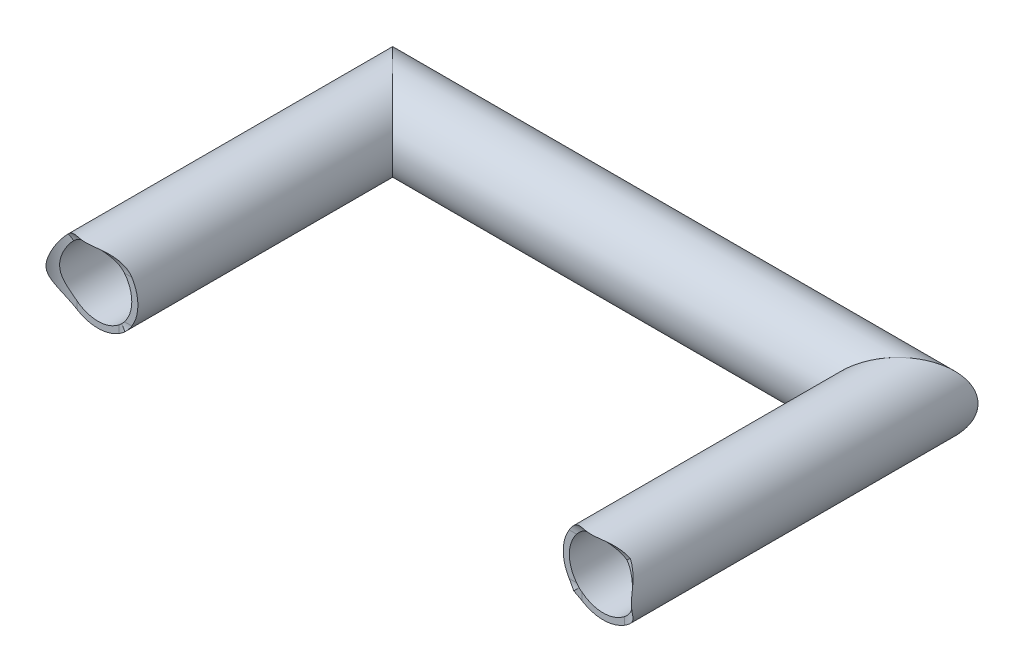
ISO-10303-21;
HEADER;
FILE_DESCRIPTION(('STEP AP214'),'2;1');
FILE_NAME('part.step','',(''),(''),'','','');
FILE_SCHEMA(('AUTOMOTIVE_DESIGN { 1 0 10303 214 1 1 1 1 }'));
ENDSEC;
DATA;
#1=APPLICATION_CONTEXT('core data for automotive mechanical design processes');
#2=APPLICATION_PROTOCOL_DEFINITION('international standard','automotive_design',2000,#1);
#3=PRODUCT_CONTEXT('',#1,'mechanical');
#4=PRODUCT('Part','Part','',(#3));
#5=PRODUCT_RELATED_PRODUCT_CATEGORY('part','',(#4));
#6=PRODUCT_DEFINITION_FORMATION('','',#4);
#7=PRODUCT_DEFINITION_CONTEXT('part definition',#1,'design');
#8=PRODUCT_DEFINITION('design','',#6,#7);
#9=PRODUCT_DEFINITION_SHAPE('','',#8);
#10=(LENGTH_UNIT() NAMED_UNIT(*) SI_UNIT(.MILLI.,.METRE.));
#11=(NAMED_UNIT(*) PLANE_ANGLE_UNIT() SI_UNIT($,.RADIAN.));
#12=(NAMED_UNIT(*) SI_UNIT($,.STERADIAN.) SOLID_ANGLE_UNIT());
#13=UNCERTAINTY_MEASURE_WITH_UNIT(LENGTH_MEASURE(1.E-05),#10,'distance_accuracy_value','');
#14=(GEOMETRIC_REPRESENTATION_CONTEXT(3) GLOBAL_UNCERTAINTY_ASSIGNED_CONTEXT((#13)) GLOBAL_UNIT_ASSIGNED_CONTEXT((#10,
#11,#12)) REPRESENTATION_CONTEXT('',''));
#15=CARTESIAN_POINT('',(0.,0.,0.));
#16=DIRECTION('',(0.,0.,1.));
#17=DIRECTION('',(1.,0.,0.));
#18=AXIS2_PLACEMENT_3D('',#15,#16,#17);
#19=CARTESIAN_POINT('',(304.8,0.,-203.2));
#20=DIRECTION('',(-1.,0.,0.));
#21=DIRECTION('',(0.,0.,1.));
#22=AXIS2_PLACEMENT_3D('',#19,#20,#21);
#23=CYLINDRICAL_SURFACE('',#22,20.447);
#24=CARTESIAN_POINT('',(0.,0.,-203.2));
#25=DIRECTION('',(0.707106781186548,0.,-0.707106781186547));
#26=DIRECTION('',(-0.707106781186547,0.,-0.707106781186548));
#27=AXIS2_PLACEMENT_3D('',#24,#25,#26);
#28=ELLIPSE('',#27,28.9164247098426,20.447);
#29=CARTESIAN_POINT('',(-20.447,0.,-223.647));
#30=VERTEX_POINT('',#29);
#31=EDGE_CURVE('E42',#30,#30,#28,.T.);
#32=ORIENTED_EDGE('',*,*,#31,.F.);
#33=EDGE_LOOP('',(#32));
#34=FACE_BOUND('',#33,.T.);
#35=CARTESIAN_POINT('',(304.8,0.,-203.2));
#36=DIRECTION('',(0.707106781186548,0.,0.707106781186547));
#37=DIRECTION('',(-0.707106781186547,0.,0.707106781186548));
#38=AXIS2_PLACEMENT_3D('',#35,#36,#37);
#39=ELLIPSE('',#38,28.9164247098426,20.447);
#40=CARTESIAN_POINT('',(284.353,0.,-182.753));
#41=VERTEX_POINT('',#40);
#42=EDGE_CURVE('E51',#41,#41,#39,.T.);
#43=ORIENTED_EDGE('',*,*,#42,.T.);
#44=EDGE_LOOP('',(#43));
#45=FACE_BOUND('',#44,.T.);
#46=ADVANCED_FACE('F35',(#34,#45),#23,.F.);
#47=CARTESIAN_POINT('',(304.8,0.,-203.2));
#48=DIRECTION('',(0.707106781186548,0.,0.707106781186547));
#49=DIRECTION('',(0.707106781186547,0.,-0.707106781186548));
#50=AXIS2_PLACEMENT_3D('',#47,#48,#49);
#51=PLANE('',#50);
#52=ORIENTED_EDGE('',*,*,#42,.F.);
#53=EDGE_LOOP('',(#52));
#54=FACE_BOUND('',#53,.T.);
#55=CARTESIAN_POINT('',(304.8,0.,-203.2));
#56=DIRECTION('',(0.707106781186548,0.,0.707106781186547));
#57=DIRECTION('',(-0.707106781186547,0.,0.707106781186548));
#58=AXIS2_PLACEMENT_3D('',#55,#56,#57);
#59=ELLIPSE('',#58,34.1249732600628,24.13);
#60=CARTESIAN_POINT('',(280.67,0.,-179.07));
#61=VERTEX_POINT('',#60);
#62=EDGE_CURVE('E46',#61,#61,#59,.T.);
#63=ORIENTED_EDGE('',*,*,#62,.T.);
#64=EDGE_LOOP('',(#63));
#65=FACE_BOUND('',#64,.T.);
#66=ADVANCED_FACE('F37',(#54,#65),#51,.T.);
#67=CARTESIAN_POINT('',(304.8,0.,-203.2));
#68=DIRECTION('',(-1.,0.,0.));
#69=DIRECTION('',(0.,0.,1.));
#70=AXIS2_PLACEMENT_3D('',#67,#68,#69);
#71=CYLINDRICAL_SURFACE('',#70,24.13);
#72=CARTESIAN_POINT('',(0.,0.,-203.2));
#73=DIRECTION('',(0.707106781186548,0.,-0.707106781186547));
#74=DIRECTION('',(-0.707106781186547,0.,-0.707106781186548));
#75=AXIS2_PLACEMENT_3D('',#72,#73,#74);
#76=ELLIPSE('',#75,34.1249732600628,24.13);
#77=CARTESIAN_POINT('',(-24.13,0.,-227.33));
#78=VERTEX_POINT('',#77);
#79=EDGE_CURVE('E11',#78,#78,#76,.T.);
#80=ORIENTED_EDGE('',*,*,#79,.T.);
#81=EDGE_LOOP('',(#80));
#82=FACE_BOUND('',#81,.T.);
#83=ORIENTED_EDGE('',*,*,#62,.F.);
#84=EDGE_LOOP('',(#83));
#85=FACE_BOUND('',#84,.T.);
#86=ADVANCED_FACE('F59',(#82,#85),#71,.T.);
#87=CARTESIAN_POINT('',(0.,0.,-203.2));
#88=DIRECTION('',(0.707106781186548,0.,-0.707106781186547));
#89=DIRECTION('',(-0.707106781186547,0.,-0.707106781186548));
#90=AXIS2_PLACEMENT_3D('',#87,#88,#89);
#91=PLANE('',#90);
#92=ORIENTED_EDGE('',*,*,#31,.T.);
#93=EDGE_LOOP('',(#92));
#94=FACE_BOUND('',#93,.T.);
#95=ORIENTED_EDGE('',*,*,#79,.F.);
#96=EDGE_LOOP('',(#95));
#97=FACE_BOUND('',#96,.T.);
#98=ADVANCED_FACE('F63',(#94,#97),#91,.F.);
#99=CLOSED_SHELL('',(#46,#66,#86,#98));
#100=MANIFOLD_SOLID_BREP('B2',#99);
#101=CARTESIAN_POINT('',(304.8,0.,0.));
#102=DIRECTION('',(0.,0.,-1.));
#103=DIRECTION('',(-1.,0.,0.));
#104=AXIS2_PLACEMENT_3D('',#101,#102,#103);
#105=CYLINDRICAL_SURFACE('',#104,20.447);
#106=CARTESIAN_POINT('',(304.8,0.,-203.2));
#107=DIRECTION('',(0.707106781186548,0.,0.707106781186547));
#108=DIRECTION('',(0.707106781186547,0.,-0.707106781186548));
#109=AXIS2_PLACEMENT_3D('',#106,#107,#108);
#110=ELLIPSE('',#109,28.9164247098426,20.447);
#111=CARTESIAN_POINT('',(325.247,0.,-223.647));
#112=VERTEX_POINT('',#111);
#113=EDGE_CURVE('E160',#112,#112,#110,.T.);
#114=ORIENTED_EDGE('',*,*,#113,.F.);
#115=EDGE_LOOP('',(#114));
#116=FACE_BOUND('',#115,.T.);
#117=CARTESIAN_POINT('',(317.5,-16.0246625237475,-25.4));
#118=CARTESIAN_POINT('',(317.713843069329,-15.8551998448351,-25.4000003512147));
#119=CARTESIAN_POINT('',(317.924245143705,-15.681468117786,-25.3945995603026));
#120=CARTESIAN_POINT('',(318.337596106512,-15.326038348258,-25.3740377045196));
#121=CARTESIAN_POINT('',(318.540547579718,-15.1443431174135,-25.3588800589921));
#122=CARTESIAN_POINT('',(318.938175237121,-14.773812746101,-25.3198844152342));
#123=CARTESIAN_POINT('',(319.132867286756,-14.5849927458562,-25.2960639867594));
#124=CARTESIAN_POINT('',(319.514058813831,-14.2003389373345,-25.2407601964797));
#125=CARTESIAN_POINT('',(319.700557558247,-14.0045045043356,-25.2092761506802));
#126=CARTESIAN_POINT('',(320.24467729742,-13.4100273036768,-25.1053392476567));
#127=CARTESIAN_POINT('',(320.589896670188,-13.0016323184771,-25.0230799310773));
#128=CARTESIAN_POINT('',(321.245576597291,-12.1617040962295,-24.8398778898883));
#129=CARTESIAN_POINT('',(321.556020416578,-11.7301598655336,-24.7389262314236));
#130=CARTESIAN_POINT('',(322.112292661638,-10.8900093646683,-24.5361927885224));
#131=CARTESIAN_POINT('',(322.36147533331,-10.4833614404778,-24.4354824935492));
#132=CARTESIAN_POINT('',(322.830362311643,-9.6546704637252,-24.2300810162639));
#133=CARTESIAN_POINT('',(323.050072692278,-9.23263060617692,-24.1253906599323));
#134=CARTESIAN_POINT('',(323.665323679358,-7.94275112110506,-23.812633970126));
#135=CARTESIAN_POINT('',(324.016217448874,-7.05231078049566,-23.6061904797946));
#136=CARTESIAN_POINT('',(324.448443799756,-5.67893614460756,-23.3319532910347));
#137=CARTESIAN_POINT('',(324.577005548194,-5.21383208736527,-23.2463017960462));
#138=CARTESIAN_POINT('',(324.801409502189,-4.27283919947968,-23.0922077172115));
#139=CARTESIAN_POINT('',(324.897253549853,-3.79695097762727,-23.0237641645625));
#140=CARTESIAN_POINT('',(325.05487742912,-2.83816491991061,-22.9089847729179));
#141=CARTESIAN_POINT('',(325.116743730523,-2.35528811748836,-22.8625928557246));
#142=CARTESIAN_POINT('',(325.205888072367,-1.38456415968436,-22.7951699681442));
#143=CARTESIAN_POINT('',(325.233168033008,-0.896717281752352,-22.7741375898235));
#144=CARTESIAN_POINT('',(325.2527068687,0.0815660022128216,-22.759110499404));
#145=CARTESIAN_POINT('',(325.244860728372,0.572005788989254,-22.7651968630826));
#146=CARTESIAN_POINT('',(325.194047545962,1.54997605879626,-22.8040894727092));
#147=CARTESIAN_POINT('',(325.151079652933,2.0375064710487,-22.8368963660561));
#148=CARTESIAN_POINT('',(325.03055174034,3.00733560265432,-22.9267493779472));
#149=CARTESIAN_POINT('',(324.952896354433,3.4896161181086,-22.9838623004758));
#150=CARTESIAN_POINT('',(324.764006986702,4.44469559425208,-23.1181365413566));
#151=CARTESIAN_POINT('',(324.652768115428,4.91749316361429,-23.1953007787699));
#152=CARTESIAN_POINT('',(324.372043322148,5.94588829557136,-23.3817059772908));
#153=CARTESIAN_POINT('',(324.195329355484,6.4989102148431,-23.4942779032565));
#154=CARTESIAN_POINT('',(323.796633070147,7.58570753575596,-23.7315992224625));
#155=CARTESIAN_POINT('',(323.574640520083,8.11947855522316,-23.8563513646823));
#156=CARTESIAN_POINT('',(323.086998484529,9.16502754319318,-24.1083594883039));
#157=CARTESIAN_POINT('',(322.821415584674,9.67683757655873,-24.2356113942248));
#158=CARTESIAN_POINT('',(322.247215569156,10.6774111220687,-24.4835366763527));
#159=CARTESIAN_POINT('',(321.93860215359,11.1661766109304,-24.6042106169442));
#160=CARTESIAN_POINT('',(321.326525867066,12.0498808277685,-24.813494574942));
#161=CARTESIAN_POINT('',(321.028687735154,12.4482140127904,-24.9042205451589));
#162=CARTESIAN_POINT('',(320.402941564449,13.2240786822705,-25.0680024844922));
#163=CARTESIAN_POINT('',(320.075050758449,13.6016218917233,-25.1410684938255));
#164=CARTESIAN_POINT('',(319.388613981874,14.3354639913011,-25.2636450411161));
#165=CARTESIAN_POINT('',(319.029933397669,14.6916566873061,-25.3130452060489));
#166=CARTESIAN_POINT('',(318.471375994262,15.2065003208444,-25.3641815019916));
#167=CARTESIAN_POINT('',(318.281558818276,15.3750394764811,-25.3774013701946));
#168=CARTESIAN_POINT('',(317.895496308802,15.705169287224,-25.3953111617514));
#169=CARTESIAN_POINT('',(317.699249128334,15.8667579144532,-25.39999861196));
#170=CARTESIAN_POINT('',(317.5,16.0246625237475,-25.4));
#171=B_SPLINE_CURVE_WITH_KNOTS('',3,(#117,#118,#119,#120,#121,#122,#123,#124,#125,#126,#127,
#128,#129,#130,#131,#132,#133,#134,#135,#136,#137,#138,#139,#140,#141,#142,#143,#144,#145,#146,
#147,#148,#149,#150,#151,#152,#153,#154,#155,#156,#157,#158,#159,#160,#161,#162,#163,#164,#165,
#166,#167,#168,#169,#170),.UNSPECIFIED.,.F.,.F.,(4,2,2,2,2,2,2,2,2,2,2,2,2,2,2,2,2,2,2,2,2,2,2,
2,2,2,4),(0.,0.818371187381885,1.63645572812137,2.45289020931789,3.26939758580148,
4.89021170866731,6.51180249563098,7.97286515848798,9.43362624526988,12.3593869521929,
13.8285126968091,15.2975557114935,16.7628426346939,18.2280482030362,19.6976371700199,
21.1672617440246,22.640951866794,24.1148566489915,25.8866155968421,27.6587753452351,
29.428252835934,31.1975782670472,32.7128189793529,34.2271961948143,35.7485690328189,
36.5108463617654,37.2733446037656),.UNSPECIFIED.);
#172=CARTESIAN_POINT('',(317.5,-16.0246625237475,-25.4));
#173=VERTEX_POINT('',#172);
#174=CARTESIAN_POINT('',(319.258212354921,14.4582123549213,-25.2777060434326));
#175=VERTEX_POINT('',#174);
#176=EDGE_CURVE('E117',#173,#175,#171,.T.);
#177=ORIENTED_EDGE('',*,*,#176,.T.);
#178=CARTESIAN_POINT('',(320.824662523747,12.7,-25.4));
#179=CARTESIAN_POINT('',(320.655199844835,12.913843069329,-25.4000003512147));
#180=CARTESIAN_POINT('',(320.481468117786,13.1242451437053,-25.3945995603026));
#181=CARTESIAN_POINT('',(320.126038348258,13.5375961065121,-25.3740377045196));
#182=CARTESIAN_POINT('',(319.944343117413,13.7405475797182,-25.3588800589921));
#183=CARTESIAN_POINT('',(319.573812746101,14.1381752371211,-25.3198844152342));
#184=CARTESIAN_POINT('',(319.384992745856,14.3328672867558,-25.2960639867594));
#185=CARTESIAN_POINT('',(319.000338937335,14.7140588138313,-25.2407601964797));
#186=CARTESIAN_POINT('',(318.804504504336,14.9005575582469,-25.2092761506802));
#187=CARTESIAN_POINT('',(318.210027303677,15.4446772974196,-25.1053392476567));
#188=CARTESIAN_POINT('',(317.801632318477,15.7898966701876,-25.0230799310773));
#189=CARTESIAN_POINT('',(316.96170409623,16.4455765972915,-24.8398778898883));
#190=CARTESIAN_POINT('',(316.530159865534,16.7560204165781,-24.7389262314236));
#191=CARTESIAN_POINT('',(315.690009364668,17.3122926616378,-24.5361927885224));
#192=CARTESIAN_POINT('',(315.283361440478,17.5614753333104,-24.4354824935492));
#193=CARTESIAN_POINT('',(314.454670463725,18.0303623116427,-24.2300810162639));
#194=CARTESIAN_POINT('',(314.032630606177,18.2500726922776,-24.1253906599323));
#195=CARTESIAN_POINT('',(312.742751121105,18.865323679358,-23.812633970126));
#196=CARTESIAN_POINT('',(311.852310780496,19.2162174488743,-23.6061904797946));
#197=CARTESIAN_POINT('',(310.478936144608,19.6484437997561,-23.3319532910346));
#198=CARTESIAN_POINT('',(310.013832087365,19.777005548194,-23.2463017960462));
#199=CARTESIAN_POINT('',(309.07283919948,20.0014095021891,-23.0922077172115));
#200=CARTESIAN_POINT('',(308.596950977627,20.0972535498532,-23.0237641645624));
#201=CARTESIAN_POINT('',(307.638164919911,20.25487742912,-22.9089847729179));
#202=CARTESIAN_POINT('',(307.155288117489,20.3167437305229,-22.8625928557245));
#203=CARTESIAN_POINT('',(306.184564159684,20.4058880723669,-22.7951699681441));
#204=CARTESIAN_POINT('',(305.696717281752,20.4331680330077,-22.7741375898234));
#205=CARTESIAN_POINT('',(304.718433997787,20.4527068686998,-22.7591104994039));
#206=CARTESIAN_POINT('',(304.227994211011,20.4448607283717,-22.7651968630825));
#207=CARTESIAN_POINT('',(303.250023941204,20.3940475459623,-22.8040894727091));
#208=CARTESIAN_POINT('',(302.762493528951,20.3510796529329,-22.836896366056));
#209=CARTESIAN_POINT('',(301.792664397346,20.2305517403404,-22.9267493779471));
#210=CARTESIAN_POINT('',(301.310383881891,20.1528963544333,-22.9838623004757));
#211=CARTESIAN_POINT('',(300.355304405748,19.9640069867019,-23.1181365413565));
#212=CARTESIAN_POINT('',(299.882506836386,19.8527681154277,-23.1953007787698));
#213=CARTESIAN_POINT('',(298.854111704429,19.5720433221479,-23.3817059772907));
#214=CARTESIAN_POINT('',(298.301089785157,19.395329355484,-23.4942779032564));
#215=CARTESIAN_POINT('',(297.214292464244,18.9966330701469,-23.7315992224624));
#216=CARTESIAN_POINT('',(296.680521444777,18.774640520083,-23.8563513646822));
#217=CARTESIAN_POINT('',(295.634972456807,18.2869984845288,-24.1083594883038));
#218=CARTESIAN_POINT('',(295.123162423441,18.0214155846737,-24.2356113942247));
#219=CARTESIAN_POINT('',(294.122588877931,17.4472155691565,-24.4835366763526));
#220=CARTESIAN_POINT('',(293.63382338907,17.1386021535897,-24.6042106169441));
#221=CARTESIAN_POINT('',(292.750119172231,16.5265258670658,-24.8134945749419));
#222=CARTESIAN_POINT('',(292.35178598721,16.2286877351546,-24.9042205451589));
#223=CARTESIAN_POINT('',(291.575921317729,15.6029415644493,-25.0680024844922));
#224=CARTESIAN_POINT('',(291.198378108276,15.2750507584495,-25.1410684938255));
#225=CARTESIAN_POINT('',(290.464536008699,14.5886139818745,-25.2636450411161));
#226=CARTESIAN_POINT('',(290.108343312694,14.2299333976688,-25.3130452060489));
#227=CARTESIAN_POINT('',(289.593499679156,13.6713759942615,-25.3641815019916));
#228=CARTESIAN_POINT('',(289.424960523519,13.4815588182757,-25.3774013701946));
#229=CARTESIAN_POINT('',(289.094830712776,13.095496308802,-25.3953111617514));
#230=CARTESIAN_POINT('',(288.933242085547,12.8992491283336,-25.39999861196));
#231=CARTESIAN_POINT('',(288.775337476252,12.7,-25.4));
#232=B_SPLINE_CURVE_WITH_KNOTS('',3,(#178,#179,#180,#181,#182,#183,#184,#185,#186,#187,#188,
#189,#190,#191,#192,#193,#194,#195,#196,#197,#198,#199,#200,#201,#202,#203,#204,#205,#206,#207,
#208,#209,#210,#211,#212,#213,#214,#215,#216,#217,#218,#219,#220,#221,#222,#223,#224,#225,#226,
#227,#228,#229,#230,#231),.UNSPECIFIED.,.F.,.F.,(4,2,2,2,2,2,2,2,2,2,2,2,2,2,2,2,2,2,2,2,2,2,2,
2,2,2,4),(0.,0.81837118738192,1.63645572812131,2.45289020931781,3.26939758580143,
4.89021170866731,6.51180249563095,7.97286515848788,9.43362624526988,12.3593869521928,
13.8285126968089,15.2975557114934,16.7628426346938,18.2280482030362,19.69763717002,
21.1672617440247,22.6409518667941,24.1148566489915,25.8866155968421,27.6587753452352,
29.428252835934,31.1975782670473,32.7128189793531,34.2271961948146,35.7485690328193,
36.5108463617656,37.2733446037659),.UNSPECIFIED.);
#233=CARTESIAN_POINT('',(288.775337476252,12.7,-25.4));
#234=VERTEX_POINT('',#233);
#235=EDGE_CURVE('E205',#175,#234,#232,.T.);
#236=ORIENTED_EDGE('',*,*,#235,.T.);
#237=CARTESIAN_POINT('',(304.8,0.,-25.4));
#238=DIRECTION('',(0.,0.,1.));
#239=DIRECTION('',(1.,0.,0.));
#240=AXIS2_PLACEMENT_3D('',#237,#238,#239);
#241=CIRCLE('',#240,20.447);
#242=CARTESIAN_POINT('',(288.775337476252,-12.7,-25.4));
#243=VERTEX_POINT('',#242);
#244=EDGE_CURVE('E204',#234,#243,#241,.T.);
#245=ORIENTED_EDGE('',*,*,#244,.T.);
#246=CARTESIAN_POINT('',(288.775337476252,-12.7,-25.4));
#247=CARTESIAN_POINT('',(288.953161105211,-12.9243964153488,-25.4000004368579));
#248=CARTESIAN_POINT('',(289.135685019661,-13.144999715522,-25.3940535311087));
#249=CARTESIAN_POINT('',(289.50947229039,-13.5779670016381,-25.3714695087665));
#250=CARTESIAN_POINT('',(289.700732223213,-13.7903341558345,-25.3548365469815));
#251=CARTESIAN_POINT('',(290.089676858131,-14.2044427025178,-25.312279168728));
#252=CARTESIAN_POINT('',(290.287286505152,-14.4062637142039,-25.2864414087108));
#253=CARTESIAN_POINT('',(290.690051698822,-14.8009694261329,-25.2266025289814));
#254=CARTESIAN_POINT('',(290.895207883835,-14.9938533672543,-25.1926007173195));
#255=CARTESIAN_POINT('',(291.521000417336,-15.5583859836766,-25.0800993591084));
#256=CARTESIAN_POINT('',(291.952266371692,-15.9162402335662,-24.9910670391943));
#257=CARTESIAN_POINT('',(292.843981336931,-16.5967286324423,-24.7926505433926));
#258=CARTESIAN_POINT('',(293.304665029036,-16.9190031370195,-24.6830842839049));
#259=CARTESIAN_POINT('',(293.7764,-17.2209190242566,-24.5680786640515));
#260=B_SPLINE_CURVE_WITH_KNOTS('',3,(#246,#247,#248,#249,#250,#251,#252,#253,#254,#255,#256,
#257,#258,#259),.UNSPECIFIED.,.F.,.F.,(4,2,2,2,2,2,4),(0.,0.85873499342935,1.71713630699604,
2.56766114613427,3.41825809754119,5.11811548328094,6.83382807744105),.UNSPECIFIED.);
#261=CARTESIAN_POINT('',(290.341787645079,-14.4582123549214,-25.2777060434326));
#262=VERTEX_POINT('',#261);
#263=EDGE_CURVE('E148',#243,#262,#260,.T.);
#264=ORIENTED_EDGE('',*,*,#263,.T.);
#265=CARTESIAN_POINT('',(287.984873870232,-11.6332,-24.7148132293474));
#266=CARTESIAN_POINT('',(288.269156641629,-12.0441421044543,-24.8121607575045));
#267=CARTESIAN_POINT('',(288.56930231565,-12.4457564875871,-24.9037009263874));
#268=CARTESIAN_POINT('',(289.197832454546,-13.2250039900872,-25.0681986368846));
#269=CARTESIAN_POINT('',(289.525983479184,-13.6027969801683,-25.1412928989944));
#270=CARTESIAN_POINT('',(290.211529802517,-14.3355480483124,-25.2636308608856));
#271=CARTESIAN_POINT('',(290.568934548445,-14.6904986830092,-25.3128668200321));
#272=CARTESIAN_POINT('',(291.12651041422,-15.2046093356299,-25.3640253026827));
#273=CARTESIAN_POINT('',(291.316730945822,-15.3735491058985,-25.3773023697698));
#274=CARTESIAN_POINT('',(291.703627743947,-15.7044479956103,-25.3952900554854));
#275=CARTESIAN_POINT('',(291.900305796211,-15.8664051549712,-25.3999982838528));
#276=CARTESIAN_POINT('',(292.1,-16.0246625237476,-25.4));
#277=B_SPLINE_CURVE_WITH_KNOTS('',3,(#265,#266,#267,#268,#269,#270,#271,#272,#273,#274,#275,
#276),.UNSPECIFIED.,.F.,.F.,(4,2,2,2,2,4),(0.,1.5271999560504,3.04272389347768,4.55873920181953,
5.32272502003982,6.0869239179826),.UNSPECIFIED.);
#278=CARTESIAN_POINT('',(292.1,-16.0246625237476,-25.4));
#279=VERTEX_POINT('',#278);
#280=EDGE_CURVE('E203',#262,#279,#277,.T.);
#281=ORIENTED_EDGE('',*,*,#280,.T.);
#282=EDGE_CURVE('E236',#279,#173,#241,.T.);
#283=ORIENTED_EDGE('',*,*,#282,.T.);
#284=EDGE_LOOP('',(#177,#236,#245,#264,#281,#283));
#285=FACE_BOUND('',#284,.T.);
#286=ADVANCED_FACE('F97',(#116,#285),#105,.F.);
#287=CARTESIAN_POINT('',(304.8,0.,0.));
#288=DIRECTION('',(0.,0.,-1.));
#289=DIRECTION('',(-1.,0.,0.));
#290=AXIS2_PLACEMENT_3D('',#287,#288,#289);
#291=CYLINDRICAL_SURFACE('',#290,24.13);
#292=CARTESIAN_POINT('',(304.8,0.,-203.2));
#293=DIRECTION('',(0.707106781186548,0.,0.707106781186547));
#294=DIRECTION('',(0.707106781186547,0.,-0.707106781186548));
#295=AXIS2_PLACEMENT_3D('',#292,#293,#294);
#296=ELLIPSE('',#295,34.1249732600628,24.13);
#297=CARTESIAN_POINT('',(328.93,0.,-227.33));
#298=VERTEX_POINT('',#297);
#299=EDGE_CURVE('E185',#298,#298,#296,.T.);
#300=ORIENTED_EDGE('',*,*,#299,.T.);
#301=EDGE_LOOP('',(#300));
#302=FACE_BOUND('',#301,.T.);
#303=CARTESIAN_POINT('',(325.317477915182,12.7,-25.4));
#304=CARTESIAN_POINT('',(325.172971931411,12.9334812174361,-25.40000266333));
#305=CARTESIAN_POINT('',(325.024482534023,13.1644443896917,-25.3935621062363));
#306=CARTESIAN_POINT('',(324.720084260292,13.620651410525,-25.3686442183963));
#307=CARTESIAN_POINT('',(324.564178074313,13.8458972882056,-25.3501712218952));
#308=CARTESIAN_POINT('',(324.245785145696,14.2896031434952,-25.3020967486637));
#309=CARTESIAN_POINT('',(324.083315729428,14.5080786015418,-25.2725230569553));
#310=CARTESIAN_POINT('',(323.75191820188,14.9383895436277,-25.2030845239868));
#311=CARTESIAN_POINT('',(323.582989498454,15.1502244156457,-25.1632187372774));
#312=CARTESIAN_POINT('',(323.072552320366,15.7687448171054,-25.0308034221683));
#313=CARTESIAN_POINT('',(322.722346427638,16.1654545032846,-24.9246222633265));
#314=CARTESIAN_POINT('',(322.001746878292,16.9302502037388,-24.6814953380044));
#315=CARTESIAN_POINT('',(321.63133863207,17.2983150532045,-24.5445271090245));
#316=CARTESIAN_POINT('',(320.7859620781,18.0862364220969,-24.210910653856));
#317=CARTESIAN_POINT('',(320.306517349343,18.4985740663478,-24.0077805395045));
#318=CARTESIAN_POINT('',(319.570747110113,19.0835064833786,-23.6813808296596));
#319=CARTESIAN_POINT('',(319.322687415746,19.2729123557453,-23.5689463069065));
#320=CARTESIAN_POINT('',(318.821279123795,19.6407044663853,-23.337847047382));
#321=CARTESIAN_POINT('',(318.567929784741,19.8190891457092,-23.2191814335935));
#322=CARTESIAN_POINT('',(317.795748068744,20.3409924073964,-22.8531729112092));
#323=CARTESIAN_POINT('',(317.26926329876,20.6677076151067,-22.597838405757));
#324=CARTESIAN_POINT('',(316.197683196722,21.2774525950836,-22.0743610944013));
#325=CARTESIAN_POINT('',(315.652584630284,21.5604747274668,-21.8062160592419));
#326=CARTESIAN_POINT('',(314.807708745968,21.9591861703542,-21.3946190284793));
#327=CARTESIAN_POINT('',(314.514531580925,22.0904495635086,-21.2525048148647));
#328=CARTESIAN_POINT('',(313.922984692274,22.3412461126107,-20.968748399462));
#329=CARTESIAN_POINT('',(313.624615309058,22.460780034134,-20.8271061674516));
#330=CARTESIAN_POINT('',(313.022136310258,22.6882604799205,-20.5458521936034));
#331=CARTESIAN_POINT('',(312.718021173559,22.7961951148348,-20.4062426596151));
#332=CARTESIAN_POINT('',(312.103963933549,23.0002978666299,-20.1312298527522));
#333=CARTESIAN_POINT('',(311.794021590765,23.0964654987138,-19.9958267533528));
#334=CARTESIAN_POINT('',(311.170709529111,23.2760648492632,-19.7329196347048));
#335=CARTESIAN_POINT('',(310.857396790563,23.3596046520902,-19.6053548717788));
#336=CARTESIAN_POINT('',(310.22405496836,23.5147365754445,-19.3597720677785));
#337=CARTESIAN_POINT('',(309.904025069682,23.5863272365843,-19.2417551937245));
#338=CARTESIAN_POINT('',(309.257462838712,23.7170082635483,-19.0191893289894));
#339=CARTESIAN_POINT('',(308.930944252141,23.7761224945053,-18.9146147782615));
#340=CARTESIAN_POINT('',(308.270753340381,23.8814245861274,-18.7230973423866));
#341=CARTESIAN_POINT('',(307.937083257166,23.9276164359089,-18.6361490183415));
#342=CARTESIAN_POINT('',(307.258708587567,24.006867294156,-18.4837931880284));
#343=CARTESIAN_POINT('',(306.913917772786,24.039752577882,-18.4186724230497));
#344=CARTESIAN_POINT('',(306.21911486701,24.0907500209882,-18.3164169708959));
#345=CARTESIAN_POINT('',(305.869104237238,24.1088662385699,-18.2792745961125));
#346=CARTESIAN_POINT('',(305.167795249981,24.1297378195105,-18.236397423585));
#347=CARTESIAN_POINT('',(304.816504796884,24.1325430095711,-18.2305607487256));
#348=CARTESIAN_POINT('',(304.115026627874,24.1228271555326,-18.2505968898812));
#349=CARTESIAN_POINT('',(303.764839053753,24.1103042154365,-18.2764736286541));
#350=CARTESIAN_POINT('',(303.07176302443,24.0705139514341,-18.3571511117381));
#351=CARTESIAN_POINT('',(302.728837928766,24.0433717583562,-18.4117062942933));
#352=CARTESIAN_POINT('',(302.049165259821,23.9751241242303,-18.5452675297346));
#353=CARTESIAN_POINT('',(301.712420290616,23.9340129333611,-18.6242836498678));
#354=CARTESIAN_POINT('',(301.044274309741,23.8383302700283,-18.8022810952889));
#355=CARTESIAN_POINT('',(300.712912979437,23.7836858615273,-18.9013700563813));
#356=CARTESIAN_POINT('',(300.057468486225,23.6617083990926,-19.1145164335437));
#357=CARTESIAN_POINT('',(299.733385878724,23.5943743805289,-19.2285749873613));
#358=CARTESIAN_POINT('',(299.077358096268,23.444118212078,-19.4731421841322));
#359=CARTESIAN_POINT('',(298.745739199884,23.3606205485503,-19.6041667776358));
#360=CARTESIAN_POINT('',(298.089433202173,23.1806168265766,-19.8744724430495));
#361=CARTESIAN_POINT('',(297.764747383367,23.0841083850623,-20.0137550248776));
#362=CARTESIAN_POINT('',(297.12157035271,22.8782148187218,-20.2976789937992));
#363=CARTESIAN_POINT('',(296.803083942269,22.7688201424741,-20.4423243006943));
#364=CARTESIAN_POINT('',(296.172080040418,22.5372768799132,-20.7344719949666));
#365=CARTESIAN_POINT('',(295.859563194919,22.4151269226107,-20.8819746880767));
#366=CARTESIAN_POINT('',(295.24012347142,22.1580265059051,-21.1778628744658));
#367=CARTESIAN_POINT('',(294.933202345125,22.0230721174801,-21.3262486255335));
#368=CARTESIAN_POINT('',(294.324892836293,21.7403202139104,-21.6221365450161));
#369=CARTESIAN_POINT('',(294.023504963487,21.5925215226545,-21.7696386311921));
#370=CARTESIAN_POINT('',(293.127931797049,21.1298665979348,-22.2082997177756));
#371=CARTESIAN_POINT('',(292.541829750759,20.7955412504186,-22.4958611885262));
#372=CARTESIAN_POINT('',(291.515275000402,20.1508758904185,-22.990905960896));
#373=CARTESIAN_POINT('',(291.070398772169,19.8506051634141,-23.2023958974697));
#374=CARTESIAN_POINT('',(290.196221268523,19.2166084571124,-23.6071176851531));
#375=CARTESIAN_POINT('',(289.766921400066,18.8828794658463,-23.8003478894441));
#376=CARTESIAN_POINT('',(288.927971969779,18.1833044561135,-24.1620135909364));
#377=CARTESIAN_POINT('',(288.518240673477,17.8176141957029,-24.3305596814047));
#378=CARTESIAN_POINT('',(287.71908378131,17.05299636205,-24.6377991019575));
#379=CARTESIAN_POINT('',(287.329650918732,16.6540808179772,-24.7765031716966));
#380=CARTESIAN_POINT('',(286.707468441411,15.9702665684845,-24.9749227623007));
#381=CARTESIAN_POINT('',(286.467824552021,15.6946696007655,-25.0452553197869));
#382=CARTESIAN_POINT('',(285.999595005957,15.1306295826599,-25.1685740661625));
#383=CARTESIAN_POINT('',(285.771004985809,14.8421916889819,-25.2215671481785));
#384=CARTESIAN_POINT('',(285.324464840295,14.251257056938,-25.3084634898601));
#385=CARTESIAN_POINT('',(285.106596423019,13.9486789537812,-25.3422362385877));
#386=CARTESIAN_POINT('',(284.684180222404,13.332327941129,-25.3880186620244));
#387=CARTESIAN_POINT('',(284.479646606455,13.0185436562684,-25.4000055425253));
#388=CARTESIAN_POINT('',(284.282522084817,12.7,-25.4));
#389=B_SPLINE_CURVE_WITH_KNOTS('',3,(#303,#304,#305,#306,#307,#308,#309,#310,#311,#312,#313,
#314,#315,#316,#317,#318,#319,#320,#321,#322,#323,#324,#325,#326,#327,#328,#329,#330,#331,#332,
#333,#334,#335,#336,#337,#338,#339,#340,#341,#342,#343,#344,#345,#346,#347,#348,#349,#350,#351,
#352,#353,#354,#355,#356,#357,#358,#359,#360,#361,#362,#363,#364,#365,#366,#367,#368,#369,#370,
#371,#372,#373,#374,#375,#376,#377,#378,#379,#380,#381,#382,#383,#384,#385,#386,#387,#388),
.UNSPECIFIED.,.F.,.F.,(4,2,2,2,2,2,2,2,2,2,2,2,2,2,2,2,2,2,2,2,2,2,2,2,2,2,2,2,2,2,2,2,2,2,2,2,
2,2,2,2,2,2,4),(0.,0.823564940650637,1.64683338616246,2.46805478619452,3.28935165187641,
4.90603350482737,6.52389875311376,8.5133262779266,9.50831763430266,10.503449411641,
12.5118532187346,14.5206078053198,15.5741739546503,16.6276712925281,17.6822383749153,
18.7368488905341,19.7818479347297,20.8269745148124,21.870083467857,22.9128700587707,
23.9688626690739,25.0245650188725,26.0768297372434,27.1292246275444,28.1727516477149,
29.2167087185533,30.2664194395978,31.3162099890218,32.4143958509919,33.5127831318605,
34.6119897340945,35.7113146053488,36.8109779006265,37.9107419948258,40.1084678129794,
41.8378896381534,43.5674672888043,45.2890418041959,47.0099957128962,48.1250868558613,
49.2397341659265,50.3618625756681,51.4851643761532),.UNSPECIFIED.);
#390=CARTESIAN_POINT('',(321.862486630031,17.0624866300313,-24.6272255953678));
#391=VERTEX_POINT('',#390);
#392=CARTESIAN_POINT('',(284.282522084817,12.7,-25.4));
#393=VERTEX_POINT('',#392);
#394=EDGE_CURVE('E217',#391,#393,#389,.T.);
#395=ORIENTED_EDGE('',*,*,#394,.F.);
#396=CARTESIAN_POINT('',(317.5,-20.5174779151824,-25.4));
#397=CARTESIAN_POINT('',(317.733481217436,-20.3729719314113,-25.40000266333));
#398=CARTESIAN_POINT('',(317.964444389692,-20.224482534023,-25.3935621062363));
#399=CARTESIAN_POINT('',(318.420651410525,-19.9200842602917,-25.3686442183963));
#400=CARTESIAN_POINT('',(318.645897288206,-19.7641780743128,-25.3501712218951));
#401=CARTESIAN_POINT('',(319.089603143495,-19.4457851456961,-25.3020967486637));
#402=CARTESIAN_POINT('',(319.308078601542,-19.2833157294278,-25.2725230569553));
#403=CARTESIAN_POINT('',(319.738389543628,-18.9519182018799,-25.2030845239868));
#404=CARTESIAN_POINT('',(319.950224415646,-18.7829894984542,-25.1632187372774));
#405=CARTESIAN_POINT('',(320.568744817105,-18.2725523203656,-25.0308034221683));
#406=CARTESIAN_POINT('',(320.965454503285,-17.9223464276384,-24.9246222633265));
#407=CARTESIAN_POINT('',(321.730250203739,-17.2017468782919,-24.6814953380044));
#408=CARTESIAN_POINT('',(322.098315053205,-16.8313386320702,-24.5445271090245));
#409=CARTESIAN_POINT('',(322.886236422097,-15.9859620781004,-24.210910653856));
#410=CARTESIAN_POINT('',(323.298574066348,-15.5065173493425,-24.0077805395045));
#411=CARTESIAN_POINT('',(323.883506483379,-14.7707471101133,-23.6813808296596));
#412=CARTESIAN_POINT('',(324.072912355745,-14.5226874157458,-23.5689463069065));
#413=CARTESIAN_POINT('',(324.440704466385,-14.0212791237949,-23.337847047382));
#414=CARTESIAN_POINT('',(324.619089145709,-13.7679297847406,-23.2191814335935));
#415=CARTESIAN_POINT('',(325.140992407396,-12.9957480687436,-22.8531729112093));
#416=CARTESIAN_POINT('',(325.467707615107,-12.4692632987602,-22.5978384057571));
#417=CARTESIAN_POINT('',(326.077452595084,-11.3976831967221,-22.0743610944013));
#418=CARTESIAN_POINT('',(326.360474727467,-10.8525846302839,-21.806216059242));
#419=CARTESIAN_POINT('',(326.759186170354,-10.007708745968,-21.3946190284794));
#420=CARTESIAN_POINT('',(326.890449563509,-9.71453158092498,-21.2525048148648));
#421=CARTESIAN_POINT('',(327.141246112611,-9.1229846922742,-20.968748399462));
#422=CARTESIAN_POINT('',(327.260780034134,-8.82461530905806,-20.8271061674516));
#423=CARTESIAN_POINT('',(327.48826047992,-8.22213631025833,-20.5458521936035));
#424=CARTESIAN_POINT('',(327.596195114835,-7.91802117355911,-20.4062426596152));
#425=CARTESIAN_POINT('',(327.80029786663,-7.30396393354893,-20.1312298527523));
#426=CARTESIAN_POINT('',(327.896465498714,-6.99402159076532,-19.9958267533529));
#427=CARTESIAN_POINT('',(328.076064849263,-6.37070952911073,-19.7329196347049));
#428=CARTESIAN_POINT('',(328.15960465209,-6.05739679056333,-19.6053548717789));
#429=CARTESIAN_POINT('',(328.314736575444,-5.42405496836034,-19.3597720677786));
#430=CARTESIAN_POINT('',(328.386327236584,-5.10402506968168,-19.2417551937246));
#431=CARTESIAN_POINT('',(328.517008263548,-4.45746283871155,-19.0191893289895));
#432=CARTESIAN_POINT('',(328.576122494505,-4.13094425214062,-18.9146147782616));
#433=CARTESIAN_POINT('',(328.681424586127,-3.47075334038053,-18.7230973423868));
#434=CARTESIAN_POINT('',(328.727616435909,-3.13708325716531,-18.6361490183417));
#435=CARTESIAN_POINT('',(328.806867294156,-2.45870858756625,-18.4837931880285));
#436=CARTESIAN_POINT('',(328.839752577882,-2.11391777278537,-18.4186724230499));
#437=CARTESIAN_POINT('',(328.890750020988,-1.41911486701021,-18.3164169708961));
#438=CARTESIAN_POINT('',(328.90886623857,-1.06910423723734,-18.2792745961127));
#439=CARTESIAN_POINT('',(328.92973781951,-0.367795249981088,-18.2363974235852));
#440=CARTESIAN_POINT('',(328.932543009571,-0.0165047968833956,-18.2305607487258));
#441=CARTESIAN_POINT('',(328.922827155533,0.684973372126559,-18.2505968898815));
#442=CARTESIAN_POINT('',(328.910304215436,1.03516094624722,-18.2764736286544));
#443=CARTESIAN_POINT('',(328.870513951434,1.72823697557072,-18.3571511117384));
#444=CARTESIAN_POINT('',(328.843371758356,2.07116207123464,-18.4117062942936));
#445=CARTESIAN_POINT('',(328.77512412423,2.75083474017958,-18.5452675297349));
#446=CARTESIAN_POINT('',(328.734012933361,3.08757970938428,-18.6242836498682));
#447=CARTESIAN_POINT('',(328.638330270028,3.75572569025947,-18.8022810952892));
#448=CARTESIAN_POINT('',(328.583685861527,4.08708702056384,-18.9013700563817));
#449=CARTESIAN_POINT('',(328.461708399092,4.7425315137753,-19.1145164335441));
#450=CARTESIAN_POINT('',(328.394374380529,5.06661412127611,-19.2285749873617));
#451=CARTESIAN_POINT('',(328.244118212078,5.72264190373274,-19.4731421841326));
#452=CARTESIAN_POINT('',(328.16062054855,6.05426080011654,-19.6041667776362));
#453=CARTESIAN_POINT('',(327.980616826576,6.71056679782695,-19.87447244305));
#454=CARTESIAN_POINT('',(327.884108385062,7.03525261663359,-20.013755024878));
#455=CARTESIAN_POINT('',(327.678214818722,7.67842964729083,-20.2976789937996));
#456=CARTESIAN_POINT('',(327.568820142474,7.99691605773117,-20.4423243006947));
#457=CARTESIAN_POINT('',(327.337276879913,8.62791995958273,-20.7344719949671));
#458=CARTESIAN_POINT('',(327.21512692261,8.94043680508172,-20.8819746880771));
#459=CARTESIAN_POINT('',(326.958026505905,9.55987652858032,-21.1778628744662));
#460=CARTESIAN_POINT('',(326.82307211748,9.86679765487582,-21.326248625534));
#461=CARTESIAN_POINT('',(326.54032021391,10.4751071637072,-21.6221365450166));
#462=CARTESIAN_POINT('',(326.392521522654,10.776495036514,-21.7696386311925));
#463=CARTESIAN_POINT('',(325.929866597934,11.6720682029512,-22.2082997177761));
#464=CARTESIAN_POINT('',(325.595541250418,12.2581702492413,-22.4958611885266));
#465=CARTESIAN_POINT('',(324.950875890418,13.2847249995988,-22.9909059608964));
#466=CARTESIAN_POINT('',(324.650605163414,13.7296012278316,-23.2023958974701));
#467=CARTESIAN_POINT('',(324.016608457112,14.6037787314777,-23.6071176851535));
#468=CARTESIAN_POINT('',(323.682879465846,15.0330785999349,-23.8003478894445));
#469=CARTESIAN_POINT('',(322.983304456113,15.8720280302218,-24.1620135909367));
#470=CARTESIAN_POINT('',(322.617614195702,16.2817593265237,-24.330559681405));
#471=CARTESIAN_POINT('',(321.85299636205,17.0809162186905,-24.6377991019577));
#472=CARTESIAN_POINT('',(321.454080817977,17.4703490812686,-24.7765031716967));
#473=CARTESIAN_POINT('',(320.770266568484,18.0925315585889,-24.9749227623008));
#474=CARTESIAN_POINT('',(320.494669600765,18.3321754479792,-25.045255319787));
#475=CARTESIAN_POINT('',(319.93062958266,18.8004049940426,-25.1685740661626));
#476=CARTESIAN_POINT('',(319.642191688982,19.0289950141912,-25.2215671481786));
#477=CARTESIAN_POINT('',(319.051257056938,19.4755351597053,-25.3084634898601));
#478=CARTESIAN_POINT('',(318.748678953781,19.6934035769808,-25.3422362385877));
#479=CARTESIAN_POINT('',(318.132327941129,20.115819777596,-25.3880186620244));
#480=CARTESIAN_POINT('',(317.818543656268,20.3203533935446,-25.4000055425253));
#481=CARTESIAN_POINT('',(317.5,20.5174779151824,-25.4));
#482=B_SPLINE_CURVE_WITH_KNOTS('',3,(#396,#397,#398,#399,#400,#401,#402,#403,#404,#405,#406,
#407,#408,#409,#410,#411,#412,#413,#414,#415,#416,#417,#418,#419,#420,#421,#422,#423,#424,#425,
#426,#427,#428,#429,#430,#431,#432,#433,#434,#435,#436,#437,#438,#439,#440,#441,#442,#443,#444,
#445,#446,#447,#448,#449,#450,#451,#452,#453,#454,#455,#456,#457,#458,#459,#460,#461,#462,#463,
#464,#465,#466,#467,#468,#469,#470,#471,#472,#473,#474,#475,#476,#477,#478,#479,#480,#481),
.UNSPECIFIED.,.F.,.F.,(4,2,2,2,2,2,2,2,2,2,2,2,2,2,2,2,2,2,2,2,2,2,2,2,2,2,2,2,2,2,2,2,2,2,2,2,
2,2,2,2,2,2,4),(0.,0.82356494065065,1.64683338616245,2.46805478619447,3.28935165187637,
4.90603350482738,6.52389875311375,8.5133262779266,9.50831763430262,10.503449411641,
12.5118532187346,14.5206078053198,15.5741739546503,16.6276712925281,17.6822383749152,
18.736848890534,19.7818479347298,20.8269745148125,21.8700834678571,22.9128700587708,
23.968862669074,25.0245650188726,26.0768297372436,27.1292246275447,28.1727516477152,
29.2167087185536,30.2664194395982,31.3162099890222,32.4143958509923,33.5127831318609,
34.611989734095,35.7113146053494,36.8109779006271,37.9107419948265,40.1084678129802,
41.837889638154,43.5674672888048,45.2890418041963,47.0099957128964,48.1250868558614,
49.2397341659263,50.3618625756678,51.4851643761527),.UNSPECIFIED.);
#483=CARTESIAN_POINT('',(317.5,-20.5174779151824,-25.4));
#484=VERTEX_POINT('',#483);
#485=EDGE_CURVE('E33',#484,#391,#482,.T.);
#486=ORIENTED_EDGE('',*,*,#485,.F.);
#487=CARTESIAN_POINT('',(304.8,0.,-25.4));
#488=DIRECTION('',(0.,0.,1.));
#489=DIRECTION('',(1.,0.,0.));
#490=AXIS2_PLACEMENT_3D('',#487,#488,#489);
#491=CIRCLE('',#490,24.13);
#492=CARTESIAN_POINT('',(292.1,-20.5174779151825,-25.4));
#493=VERTEX_POINT('',#492);
#494=EDGE_CURVE('E169',#493,#484,#491,.T.);
#495=ORIENTED_EDGE('',*,*,#494,.F.);
#496=CARTESIAN_POINT('',(283.659386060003,-11.6332,-22.1892589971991));
#497=CARTESIAN_POINT('',(283.811708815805,-11.9099892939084,-22.3247485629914));
#498=CARTESIAN_POINT('',(283.96974320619,-12.1843301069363,-22.4587485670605));
#499=CARTESIAN_POINT('',(284.297453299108,-12.7280554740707,-22.7227016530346));
#500=CARTESIAN_POINT('',(284.467131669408,-12.9974388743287,-22.852653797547));
#501=CARTESIAN_POINT('',(284.99475551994,-13.7992492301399,-23.2353993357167));
#502=CARTESIAN_POINT('',(285.370506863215,-14.3239087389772,-23.4803722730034));
#503=CARTESIAN_POINT('',(286.156610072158,-15.3321808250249,-23.9323119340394));
#504=CARTESIAN_POINT('',(286.565375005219,-15.8165802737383,-24.1402791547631));
#505=CARTESIAN_POINT('',(287.427577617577,-16.7589593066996,-24.5186155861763));
#506=CARTESIAN_POINT('',(287.880957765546,-17.2169717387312,-24.6890323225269));
#507=CARTESIAN_POINT('',(288.636501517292,-17.9205246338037,-24.9221236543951));
#508=CARTESIAN_POINT('',(288.924512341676,-18.1762322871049,-25.0003344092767));
#509=CARTESIAN_POINT('',(289.515066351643,-18.6755755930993,-25.1378455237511));
#510=CARTESIAN_POINT('',(289.817605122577,-18.9192148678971,-25.1971515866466));
#511=CARTESIAN_POINT('',(290.442512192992,-19.3978693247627,-25.295424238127));
#512=CARTESIAN_POINT('',(290.765155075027,-19.6326169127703,-25.3339632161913));
#513=CARTESIAN_POINT('',(291.258714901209,-19.9732462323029,-25.3731816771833));
#514=CARTESIAN_POINT('',(291.424940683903,-20.0849400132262,-25.3831565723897));
#515=CARTESIAN_POINT('',(291.760329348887,-20.3042867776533,-25.3965661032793));
#516=CARTESIAN_POINT('',(291.929492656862,-20.4119391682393,-25.3999997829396));
#517=CARTESIAN_POINT('',(292.1,-20.5174779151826,-25.4));
#518=B_SPLINE_CURVE_WITH_KNOTS('',3,(#496,#497,#498,#499,#500,#501,#502,#503,#504,#505,#506,
#507,#508,#509,#510,#511,#512,#513,#514,#515,#516,#517),.UNSPECIFIED.,.F.,.F.,(4,2,2,2,2,2,2,2,
2,2,4),(0.,1.03115852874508,2.0625541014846,4.13065872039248,6.1292699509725,8.12533692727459,
9.30357462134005,10.481456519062,11.6827455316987,12.2841400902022,12.8856225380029),.UNSPECIFIED.);
#519=CARTESIAN_POINT('',(287.737513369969,-17.0624866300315,-24.6272255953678));
#520=VERTEX_POINT('',#519);
#521=EDGE_CURVE('E172',#520,#493,#518,.T.);
#522=ORIENTED_EDGE('',*,*,#521,.F.);
#523=CARTESIAN_POINT('',(284.282522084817,-12.7,-25.4));
#524=CARTESIAN_POINT('',(284.427760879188,-12.9346656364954,-25.4000027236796));
#525=CARTESIAN_POINT('',(284.577023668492,-13.1667872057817,-25.3934966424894));
#526=CARTESIAN_POINT('',(284.883041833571,-13.6252500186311,-25.368329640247));
#527=CARTESIAN_POINT('',(285.039794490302,-13.8515933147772,-25.3496730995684));
#528=CARTESIAN_POINT('',(285.359961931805,-14.2974475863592,-25.3011244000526));
#529=CARTESIAN_POINT('',(285.523360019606,-14.5169735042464,-25.2712590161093));
#530=CARTESIAN_POINT('',(285.856674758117,-14.9493099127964,-25.2011429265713));
#531=CARTESIAN_POINT('',(286.02659198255,-15.1621198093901,-25.1608913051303));
#532=CARTESIAN_POINT('',(286.536547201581,-15.7791898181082,-25.0281199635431));
#533=CARTESIAN_POINT('',(286.885114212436,-16.1736355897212,-24.9222307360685));
#534=CARTESIAN_POINT('',(287.602180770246,-16.934151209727,-24.6800423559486));
#535=CARTESIAN_POINT('',(287.970691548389,-17.3002047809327,-24.543725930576));
#536=CARTESIAN_POINT('',(288.758621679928,-18.0345891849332,-24.2327799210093));
#537=CARTESIAN_POINT('',(289.179647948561,-18.400202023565,-24.0558155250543));
#538=CARTESIAN_POINT('',(290.039442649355,-19.0968371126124,-23.6784998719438));
#539=CARTESIAN_POINT('',(290.478215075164,-19.4278515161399,-23.4781433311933));
#540=CARTESIAN_POINT('',(291.384592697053,-20.0648822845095,-23.0537040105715));
#541=CARTESIAN_POINT('',(291.852665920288,-20.3698833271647,-22.8290984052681));
#542=CARTESIAN_POINT('',(292.565918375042,-20.8005091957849,-22.4829257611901));
#543=CARTESIAN_POINT('',(292.805413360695,-20.9395139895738,-22.366046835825));
#544=CARTESIAN_POINT('',(293.288120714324,-21.2087203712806,-22.1299382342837));
#545=CARTESIAN_POINT('',(293.531332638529,-21.3389230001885,-22.0107088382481));
#546=CARTESIAN_POINT('',(293.7764,-21.4647884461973,-21.8906737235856));
#547=B_SPLINE_CURVE_WITH_KNOTS('',3,(#523,#524,#525,#526,#527,#528,#529,#530,#531,#532,#533,
#534,#535,#536,#537,#538,#539,#540,#541,#542,#543,#544,#545,#546),.UNSPECIFIED.,.F.,.F.,(4,2,2,
2,2,2,2,2,2,2,2,4),(0.,0.827740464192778,1.65518268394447,2.48066081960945,3.30621176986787,
4.91460314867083,6.52390990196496,8.27698545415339,10.0304577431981,11.8352556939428,
12.7368240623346,13.6382856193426),.UNSPECIFIED.);
#548=CARTESIAN_POINT('',(284.282522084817,-12.7,-25.4));
#549=VERTEX_POINT('',#548);
#550=EDGE_CURVE('E155',#549,#520,#547,.T.);
#551=ORIENTED_EDGE('',*,*,#550,.F.);
#552=EDGE_CURVE('E108',#393,#549,#491,.T.);
#553=ORIENTED_EDGE('',*,*,#552,.F.);
#554=EDGE_LOOP('',(#395,#486,#495,#522,#551,#553));
#555=FACE_BOUND('',#554,.T.);
#556=ADVANCED_FACE('F99',(#302,#555),#291,.T.);
#557=CARTESIAN_POINT('',(304.8,0.,-203.2));
#558=DIRECTION('',(0.707106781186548,0.,0.707106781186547));
#559=DIRECTION('',(0.707106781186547,0.,-0.707106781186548));
#560=AXIS2_PLACEMENT_3D('',#557,#558,#559);
#561=PLANE('',#560);
#562=ORIENTED_EDGE('',*,*,#113,.T.);
#563=EDGE_LOOP('',(#562));
#564=FACE_BOUND('',#563,.T.);
#565=ORIENTED_EDGE('',*,*,#299,.F.);
#566=EDGE_LOOP('',(#565));
#567=FACE_BOUND('',#566,.T.);
#568=ADVANCED_FACE('F191',(#564,#567),#561,.F.);
#569=CARTESIAN_POINT('',(304.8,-12.7,-12.7));
#570=DIRECTION('',(-1.,0.,0.));
#571=DIRECTION('',(0.,0.,1.));
#572=AXIS2_PLACEMENT_3D('',#569,#570,#571);
#573=CYLINDRICAL_SURFACE('',#572,12.7);
#574=DIRECTION('',(-1.,0.,0.));
#575=VECTOR('',#574,1.);
#576=CARTESIAN_POINT('',(304.8,-12.7,-25.4));
#577=LINE('',#576,#575);
#578=EDGE_CURVE('E102',#243,#549,#577,.T.);
#579=ORIENTED_EDGE('',*,*,#578,.T.);
#580=ORIENTED_EDGE('',*,*,#550,.T.);
#581=CARTESIAN_POINT('',(292.1,-12.7,-12.7));
#582=DIRECTION('',(0.707106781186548,-0.707106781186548,0.));
#583=DIRECTION('',(0.707106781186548,0.707106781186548,0.));
#584=AXIS2_PLACEMENT_3D('',#581,#582,#583);
#585=ELLIPSE('',#584,17.9605122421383,12.7);
#586=EDGE_CURVE('E152',#520,#262,#585,.T.);
#587=ORIENTED_EDGE('',*,*,#586,.T.);
#588=ORIENTED_EDGE('',*,*,#263,.F.);
#589=EDGE_LOOP('',(#579,#580,#587,#588));
#590=FACE_BOUND('',#589,.T.);
#591=ADVANCED_FACE('F157',(#590),#573,.F.);
#592=CARTESIAN_POINT('',(292.1,-203.2,-12.7));
#593=DIRECTION('',(0.,1.,0.));
#594=DIRECTION('',(0.,0.,1.));
#595=AXIS2_PLACEMENT_3D('',#592,#593,#594);
#596=CYLINDRICAL_SURFACE('',#595,12.7);
#597=ORIENTED_EDGE('',*,*,#586,.F.);
#598=ORIENTED_EDGE('',*,*,#521,.T.);
#599=DIRECTION('',(0.,1.,0.));
#600=VECTOR('',#599,1.);
#601=CARTESIAN_POINT('',(292.1,-203.2,-25.4));
#602=LINE('',#601,#600);
#603=EDGE_CURVE('E213',#493,#279,#602,.T.);
#604=ORIENTED_EDGE('',*,*,#603,.T.);
#605=ORIENTED_EDGE('',*,*,#280,.F.);
#606=EDGE_LOOP('',(#597,#598,#604,#605));
#607=FACE_BOUND('',#606,.T.);
#608=ADVANCED_FACE('F190',(#607),#596,.F.);
#609=CARTESIAN_POINT('',(292.1,-203.2,-25.4));
#610=DIRECTION('',(0.,0.,1.));
#611=DIRECTION('',(1.,0.,0.));
#612=AXIS2_PLACEMENT_3D('',#609,#610,#611);
#613=PLANE('',#612);
#614=ORIENTED_EDGE('',*,*,#603,.F.);
#615=ORIENTED_EDGE('',*,*,#494,.T.);
#616=DIRECTION('',(0.,1.,0.));
#617=VECTOR('',#616,1.);
#618=CARTESIAN_POINT('',(317.5,-203.2,-25.4));
#619=LINE('',#618,#617);
#620=EDGE_CURVE('E210',#484,#173,#619,.T.);
#621=ORIENTED_EDGE('',*,*,#620,.T.);
#622=ORIENTED_EDGE('',*,*,#282,.F.);
#623=EDGE_LOOP('',(#614,#615,#621,#622));
#624=FACE_BOUND('',#623,.T.);
#625=ADVANCED_FACE('F245',(#624),#613,.T.);
#626=CARTESIAN_POINT('',(304.8,12.7,-12.7));
#627=DIRECTION('',(-1.,0.,0.));
#628=DIRECTION('',(0.,0.,1.));
#629=AXIS2_PLACEMENT_3D('',#626,#627,#628);
#630=CYLINDRICAL_SURFACE('',#629,12.7);
#631=CARTESIAN_POINT('',(317.5,12.7,-12.7));
#632=DIRECTION('',(0.707106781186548,-0.707106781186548,0.));
#633=DIRECTION('',(0.707106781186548,0.707106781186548,0.));
#634=AXIS2_PLACEMENT_3D('',#631,#632,#633);
#635=ELLIPSE('',#634,17.9605122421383,12.7);
#636=EDGE_CURVE('E212',#175,#391,#635,.T.);
#637=ORIENTED_EDGE('',*,*,#636,.T.);
#638=ORIENTED_EDGE('',*,*,#394,.T.);
#639=DIRECTION('',(-1.,0.,0.));
#640=VECTOR('',#639,1.);
#641=CARTESIAN_POINT('',(304.8,12.7,-25.4));
#642=LINE('',#641,#640);
#643=EDGE_CURVE('E165',#234,#393,#642,.T.);
#644=ORIENTED_EDGE('',*,*,#643,.F.);
#645=ORIENTED_EDGE('',*,*,#235,.F.);
#646=EDGE_LOOP('',(#637,#638,#644,#645));
#647=FACE_BOUND('',#646,.T.);
#648=ADVANCED_FACE('F192',(#647),#630,.F.);
#649=ORIENTED_EDGE('',*,*,#643,.T.);
#650=ORIENTED_EDGE('',*,*,#552,.T.);
#651=ORIENTED_EDGE('',*,*,#578,.F.);
#652=ORIENTED_EDGE('',*,*,#244,.F.);
#653=EDGE_LOOP('',(#649,#650,#651,#652));
#654=FACE_BOUND('',#653,.T.);
#655=ADVANCED_FACE('F163',(#654),#613,.T.);
#656=CARTESIAN_POINT('',(317.5,-203.2,-12.7));
#657=DIRECTION('',(0.,1.,0.));
#658=DIRECTION('',(0.,0.,1.));
#659=AXIS2_PLACEMENT_3D('',#656,#657,#658);
#660=CYLINDRICAL_SURFACE('',#659,12.7);
#661=ORIENTED_EDGE('',*,*,#620,.F.);
#662=ORIENTED_EDGE('',*,*,#485,.T.);
#663=ORIENTED_EDGE('',*,*,#636,.F.);
#664=ORIENTED_EDGE('',*,*,#176,.F.);
#665=EDGE_LOOP('',(#661,#662,#663,#664));
#666=FACE_BOUND('',#665,.T.);
#667=ADVANCED_FACE('F226',(#666),#660,.F.);
#668=CLOSED_SHELL('',(#286,#556,#568,#591,#608,#625,#648,#655,#667));
#669=MANIFOLD_SOLID_BREP('B6',#668);
#670=CARTESIAN_POINT('',(0.,0.,-203.2));
#671=DIRECTION('',(0.,0.,1.));
#672=DIRECTION('',(1.,0.,0.));
#673=AXIS2_PLACEMENT_3D('',#670,#671,#672);
#674=CYLINDRICAL_SURFACE('',#673,20.447);
#675=CARTESIAN_POINT('',(0.,0.,-203.2));
#676=DIRECTION('',(0.707106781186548,0.,-0.707106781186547));
#677=DIRECTION('',(0.707106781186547,0.,0.707106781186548));
#678=AXIS2_PLACEMENT_3D('',#675,#676,#677);
#679=ELLIPSE('',#678,28.9164247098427,20.447);
#680=CARTESIAN_POINT('',(20.447,0.,-182.753));
#681=VERTEX_POINT('',#680);
#682=EDGE_CURVE('E485',#681,#681,#679,.T.);
#683=ORIENTED_EDGE('',*,*,#682,.T.);
#684=EDGE_LOOP('',(#683));
#685=FACE_BOUND('',#684,.T.);
#686=CARTESIAN_POINT('',(0.,0.,-25.4));
#687=DIRECTION('',(0.,0.,1.));
#688=DIRECTION('',(1.,0.,0.));
#689=AXIS2_PLACEMENT_3D('',#686,#687,#688);
#690=CIRCLE('',#689,20.447);
#691=CARTESIAN_POINT('',(16.0246625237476,-12.7,-25.4));
#692=VERTEX_POINT('',#691);
#693=CARTESIAN_POINT('',(16.0246625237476,12.7,-25.4));
#694=VERTEX_POINT('',#693);
#695=EDGE_CURVE('E436',#692,#694,#690,.T.);
#696=ORIENTED_EDGE('',*,*,#695,.T.);
#697=CARTESIAN_POINT('',(16.0246625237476,12.7,-25.4));
#698=CARTESIAN_POINT('',(15.8551998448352,12.913843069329,-25.4000003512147));
#699=CARTESIAN_POINT('',(15.6814681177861,13.1242451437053,-25.3945995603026));
#700=CARTESIAN_POINT('',(15.3260383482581,13.5375961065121,-25.3740377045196));
#701=CARTESIAN_POINT('',(15.1443431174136,13.7405475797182,-25.3588800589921));
#702=CARTESIAN_POINT('',(14.7738127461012,14.1381752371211,-25.3198844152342));
#703=CARTESIAN_POINT('',(14.5849927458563,14.3328672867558,-25.2960639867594));
#704=CARTESIAN_POINT('',(14.2003389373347,14.7140588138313,-25.2407601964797));
#705=CARTESIAN_POINT('',(14.0045045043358,14.9005575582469,-25.2092761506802));
#706=CARTESIAN_POINT('',(13.4100273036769,15.4446772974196,-25.1053392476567));
#707=CARTESIAN_POINT('',(13.0016323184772,15.7898966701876,-25.0230799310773));
#708=CARTESIAN_POINT('',(12.1617040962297,16.4455765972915,-24.8398778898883));
#709=CARTESIAN_POINT('',(11.7301598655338,16.7560204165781,-24.7389262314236));
#710=CARTESIAN_POINT('',(10.8900093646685,17.3122926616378,-24.5361927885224));
#711=CARTESIAN_POINT('',(10.483361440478,17.5614753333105,-24.4354824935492));
#712=CARTESIAN_POINT('',(9.65467046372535,18.0303623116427,-24.2300810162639));
#713=CARTESIAN_POINT('',(9.23263060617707,18.2500726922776,-24.1253906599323));
#714=CARTESIAN_POINT('',(7.94275112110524,18.8653236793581,-23.812633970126));
#715=CARTESIAN_POINT('',(7.05231078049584,19.2162174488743,-23.6061904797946));
#716=CARTESIAN_POINT('',(5.67893614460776,19.6484437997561,-23.3319532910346));
#717=CARTESIAN_POINT('',(5.21383208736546,19.777005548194,-23.2463017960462));
#718=CARTESIAN_POINT('',(4.27283919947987,20.0014095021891,-23.0922077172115));
#719=CARTESIAN_POINT('',(3.79695097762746,20.0972535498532,-23.0237641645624));
#720=CARTESIAN_POINT('',(2.83816491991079,20.25487742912,-22.9089847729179));
#721=CARTESIAN_POINT('',(2.35528811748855,20.3167437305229,-22.8625928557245));
#722=CARTESIAN_POINT('',(1.38456415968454,20.4058880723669,-22.7951699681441));
#723=CARTESIAN_POINT('',(0.896717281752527,20.4331680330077,-22.7741375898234));
#724=CARTESIAN_POINT('',(-0.0815660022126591,20.4527068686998,-22.7591104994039));
#725=CARTESIAN_POINT('',(-0.572005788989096,20.4448607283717,-22.7651968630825));
#726=CARTESIAN_POINT('',(-1.54997605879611,20.3940475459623,-22.8040894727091));
#727=CARTESIAN_POINT('',(-2.03750647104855,20.3510796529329,-22.836896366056));
#728=CARTESIAN_POINT('',(-3.00733560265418,20.2305517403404,-22.9267493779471));
#729=CARTESIAN_POINT('',(-3.48961611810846,20.1528963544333,-22.9838623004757));
#730=CARTESIAN_POINT('',(-4.44469559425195,19.9640069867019,-23.1181365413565));
#731=CARTESIAN_POINT('',(-4.91749316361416,19.8527681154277,-23.1953007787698));
#732=CARTESIAN_POINT('',(-5.94588829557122,19.5720433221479,-23.3817059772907));
#733=CARTESIAN_POINT('',(-6.49891021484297,19.395329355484,-23.4942779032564));
#734=CARTESIAN_POINT('',(-7.58570753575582,18.9966330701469,-23.7315992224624));
#735=CARTESIAN_POINT('',(-8.11947855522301,18.774640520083,-23.8563513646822));
#736=CARTESIAN_POINT('',(-9.16502754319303,18.2869984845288,-24.1083594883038));
#737=CARTESIAN_POINT('',(-9.67683757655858,18.0214155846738,-24.2356113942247));
#738=CARTESIAN_POINT('',(-10.6774111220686,17.4472155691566,-24.4835366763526));
#739=CARTESIAN_POINT('',(-11.1661766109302,17.1386021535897,-24.6042106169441));
#740=CARTESIAN_POINT('',(-12.0498808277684,16.5265258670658,-24.8134945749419));
#741=CARTESIAN_POINT('',(-12.4482140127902,16.2286877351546,-24.9042205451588));
#742=CARTESIAN_POINT('',(-13.2240786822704,15.6029415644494,-25.0680024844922));
#743=CARTESIAN_POINT('',(-13.6016218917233,15.2750507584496,-25.1410684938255));
#744=CARTESIAN_POINT('',(-14.3354639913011,14.5886139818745,-25.2636450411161));
#745=CARTESIAN_POINT('',(-14.6916566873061,14.2299333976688,-25.3130452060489));
#746=CARTESIAN_POINT('',(-15.2065003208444,13.6713759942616,-25.3641815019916));
#747=CARTESIAN_POINT('',(-15.3750394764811,13.4815588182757,-25.3774013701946));
#748=CARTESIAN_POINT('',(-15.705169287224,13.095496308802,-25.3953111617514));
#749=CARTESIAN_POINT('',(-15.8667579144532,12.8992491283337,-25.39999861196));
#750=CARTESIAN_POINT('',(-16.0246625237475,12.7,-25.4));
#751=B_SPLINE_CURVE_WITH_KNOTS('',3,(#697,#698,#699,#700,#701,#702,#703,#704,#705,#706,#707,
#708,#709,#710,#711,#712,#713,#714,#715,#716,#717,#718,#719,#720,#721,#722,#723,#724,#725,#726,
#727,#728,#729,#730,#731,#732,#733,#734,#735,#736,#737,#738,#739,#740,#741,#742,#743,#744,#745,
#746,#747,#748,#749,#750),.UNSPECIFIED.,.F.,.F.,(4,2,2,2,2,2,2,2,2,2,2,2,2,2,2,2,2,2,2,2,2,2,2,
2,2,2,4),(0.,0.818371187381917,1.63645572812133,2.45289020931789,3.26939758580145,
4.89021170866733,6.51180249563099,7.97286515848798,9.4336262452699,12.3593869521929,
13.828512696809,15.2975557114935,16.7628426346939,18.2280482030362,19.69763717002,
21.1672617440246,22.640951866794,24.1148566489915,25.8866155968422,27.6587753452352,
29.428252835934,31.1975782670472,32.712818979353,34.2271961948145,35.7485690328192,
36.5108463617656,37.2733446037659),.UNSPECIFIED.);
#752=CARTESIAN_POINT('',(-14.4582123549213,14.4582123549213,-25.2777060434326));
#753=VERTEX_POINT('',#752);
#754=EDGE_CURVE('E400',#694,#753,#751,.T.);
#755=ORIENTED_EDGE('',*,*,#754,.T.);
#756=CARTESIAN_POINT('',(-12.7,16.0246625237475,-25.4));
#757=CARTESIAN_POINT('',(-12.913843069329,15.8551998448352,-25.4000003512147));
#758=CARTESIAN_POINT('',(-13.1242451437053,15.6814681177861,-25.3945995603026));
#759=CARTESIAN_POINT('',(-13.5375961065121,15.3260383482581,-25.3740377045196));
#760=CARTESIAN_POINT('',(-13.7405475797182,15.1443431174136,-25.3588800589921));
#761=CARTESIAN_POINT('',(-14.1381752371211,14.7738127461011,-25.3198844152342));
#762=CARTESIAN_POINT('',(-14.3328672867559,14.5849927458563,-25.2960639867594));
#763=CARTESIAN_POINT('',(-14.7140588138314,14.2003389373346,-25.2407601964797));
#764=CARTESIAN_POINT('',(-14.900557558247,14.0045045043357,-25.2092761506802));
#765=CARTESIAN_POINT('',(-15.4446772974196,13.4100273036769,-25.1053392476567));
#766=CARTESIAN_POINT('',(-15.7898966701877,13.0016323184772,-25.0230799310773));
#767=CARTESIAN_POINT('',(-16.4455765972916,12.1617040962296,-24.8398778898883));
#768=CARTESIAN_POINT('',(-16.7560204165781,11.7301598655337,-24.7389262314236));
#769=CARTESIAN_POINT('',(-17.3122926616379,10.8900093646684,-24.5361927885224));
#770=CARTESIAN_POINT('',(-17.5614753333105,10.4833614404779,-24.4354824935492));
#771=CARTESIAN_POINT('',(-18.0303623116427,9.65467046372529,-24.2300810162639));
#772=CARTESIAN_POINT('',(-18.2500726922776,9.23263060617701,-24.1253906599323));
#773=CARTESIAN_POINT('',(-18.8653236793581,7.94275112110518,-23.812633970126));
#774=CARTESIAN_POINT('',(-19.2162174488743,7.05231078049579,-23.6061904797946));
#775=CARTESIAN_POINT('',(-19.6484437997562,5.6789361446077,-23.3319532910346));
#776=CARTESIAN_POINT('',(-19.777005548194,5.21383208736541,-23.2463017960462));
#777=CARTESIAN_POINT('',(-20.0014095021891,4.27283919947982,-23.0922077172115));
#778=CARTESIAN_POINT('',(-20.0972535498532,3.79695097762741,-23.0237641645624));
#779=CARTESIAN_POINT('',(-20.25487742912,2.83816491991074,-22.9089847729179));
#780=CARTESIAN_POINT('',(-20.3167437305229,2.3552881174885,-22.8625928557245));
#781=CARTESIAN_POINT('',(-20.4058880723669,1.3845641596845,-22.7951699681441));
#782=CARTESIAN_POINT('',(-20.4331680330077,0.896717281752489,-22.7741375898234));
#783=CARTESIAN_POINT('',(-20.4527068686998,-0.0815660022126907,-22.7591104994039));
#784=CARTESIAN_POINT('',(-20.4448607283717,-0.572005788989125,-22.7651968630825));
#785=CARTESIAN_POINT('',(-20.3940475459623,-1.54997605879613,-22.8040894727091));
#786=CARTESIAN_POINT('',(-20.3510796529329,-2.03750647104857,-22.836896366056));
#787=CARTESIAN_POINT('',(-20.2305517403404,-3.0073356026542,-22.9267493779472));
#788=CARTESIAN_POINT('',(-20.1528963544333,-3.48961611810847,-22.9838623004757));
#789=CARTESIAN_POINT('',(-19.9640069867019,-4.44469559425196,-23.1181365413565));
#790=CARTESIAN_POINT('',(-19.8527681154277,-4.91749316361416,-23.1953007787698));
#791=CARTESIAN_POINT('',(-19.5720433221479,-5.94588829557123,-23.3817059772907));
#792=CARTESIAN_POINT('',(-19.395329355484,-6.49891021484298,-23.4942779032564));
#793=CARTESIAN_POINT('',(-18.9966330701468,-7.58570753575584,-23.7315992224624));
#794=CARTESIAN_POINT('',(-18.774640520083,-8.11947855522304,-23.8563513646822));
#795=CARTESIAN_POINT('',(-18.2869984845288,-9.16502754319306,-24.1083594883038));
#796=CARTESIAN_POINT('',(-18.0214155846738,-9.67683757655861,-24.2356113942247));
#797=CARTESIAN_POINT('',(-17.4472155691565,-10.6774111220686,-24.4835366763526));
#798=CARTESIAN_POINT('',(-17.1386021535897,-11.1661766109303,-24.6042106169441));
#799=CARTESIAN_POINT('',(-16.5265258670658,-12.0498808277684,-24.8134945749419));
#800=CARTESIAN_POINT('',(-16.2286877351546,-12.4482140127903,-24.9042205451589));
#801=CARTESIAN_POINT('',(-15.6029415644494,-13.2240786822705,-25.0680024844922));
#802=CARTESIAN_POINT('',(-15.2750507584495,-13.6016218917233,-25.1410684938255));
#803=CARTESIAN_POINT('',(-14.5886139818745,-14.3354639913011,-25.2636450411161));
#804=CARTESIAN_POINT('',(-14.2299333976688,-14.6916566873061,-25.3130452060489));
#805=CARTESIAN_POINT('',(-13.6713759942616,-15.2065003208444,-25.3641815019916));
#806=CARTESIAN_POINT('',(-13.4815588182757,-15.3750394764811,-25.3774013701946));
#807=CARTESIAN_POINT('',(-13.095496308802,-15.705169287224,-25.3953111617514));
#808=CARTESIAN_POINT('',(-12.8992491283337,-15.8667579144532,-25.39999861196));
#809=CARTESIAN_POINT('',(-12.7,-16.0246625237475,-25.4));
#810=B_SPLINE_CURVE_WITH_KNOTS('',3,(#756,#757,#758,#759,#760,#761,#762,#763,#764,#765,#766,
#767,#768,#769,#770,#771,#772,#773,#774,#775,#776,#777,#778,#779,#780,#781,#782,#783,#784,#785,
#786,#787,#788,#789,#790,#791,#792,#793,#794,#795,#796,#797,#798,#799,#800,#801,#802,#803,#804,
#805,#806,#807,#808,#809),.UNSPECIFIED.,.F.,.F.,(4,2,2,2,2,2,2,2,2,2,2,2,2,2,2,2,2,2,2,2,2,2,2,
2,2,2,4),(0.,0.818371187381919,1.63645572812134,2.45289020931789,3.26939758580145,
4.89021170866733,6.511802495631,7.97286515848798,9.43362624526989,12.3593869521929,
13.828512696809,15.2975557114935,16.7628426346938,18.2280482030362,19.6976371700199,
21.1672617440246,22.640951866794,24.1148566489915,25.8866155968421,27.6587753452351,
29.428252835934,31.1975782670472,32.712818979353,34.2271961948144,35.7485690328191,
36.5108463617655,37.2733446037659),.UNSPECIFIED.);
#811=CARTESIAN_POINT('',(-12.7,-16.0246625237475,-25.4));
#812=VERTEX_POINT('',#811);
#813=EDGE_CURVE('E435',#753,#812,#810,.T.);
#814=ORIENTED_EDGE('',*,*,#813,.T.);
#815=CARTESIAN_POINT('',(12.7,-16.0246625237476,-25.4));
#816=VERTEX_POINT('',#815);
#817=EDGE_CURVE('E345',#812,#816,#690,.T.);
#818=ORIENTED_EDGE('',*,*,#817,.T.);
#819=CARTESIAN_POINT('',(12.7,-16.0246625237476,-25.4));
#820=CARTESIAN_POINT('',(12.8996942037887,-15.8664051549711,-25.3999982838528));
#821=CARTESIAN_POINT('',(13.096372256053,-15.7044479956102,-25.3952900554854));
#822=CARTESIAN_POINT('',(13.4832690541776,-15.3735491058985,-25.3773023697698));
#823=CARTESIAN_POINT('',(13.6734895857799,-15.2046093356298,-25.3640253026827));
#824=CARTESIAN_POINT('',(14.2310654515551,-14.6904986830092,-25.3128668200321));
#825=CARTESIAN_POINT('',(14.5884701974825,-14.3355480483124,-25.2636308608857));
#826=CARTESIAN_POINT('',(15.2740165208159,-13.6027969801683,-25.1412928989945));
#827=CARTESIAN_POINT('',(15.6021675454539,-13.2250039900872,-25.0681986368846));
#828=CARTESIAN_POINT('',(16.23069768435,-12.4457564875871,-24.9037009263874));
#829=CARTESIAN_POINT('',(16.5308433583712,-12.0441421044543,-24.8121607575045));
#830=CARTESIAN_POINT('',(16.8151261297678,-11.6332,-24.7148132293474));
#831=B_SPLINE_CURVE_WITH_KNOTS('',3,(#819,#820,#821,#822,#823,#824,#825,#826,#827,#828,#829,
#830),.UNSPECIFIED.,.F.,.F.,(4,2,2,2,2,4),(0.,0.764198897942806,1.52818471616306,
3.04420002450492,4.55972396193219,6.0869239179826),.UNSPECIFIED.);
#832=CARTESIAN_POINT('',(14.4582123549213,-14.4582123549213,-25.2777060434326));
#833=VERTEX_POINT('',#832);
#834=EDGE_CURVE('E368',#816,#833,#831,.T.);
#835=ORIENTED_EDGE('',*,*,#834,.T.);
#836=CARTESIAN_POINT('',(11.0236,-17.2209190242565,-24.5680786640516));
#837=CARTESIAN_POINT('',(11.4953349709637,-16.9190031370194,-24.683084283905));
#838=CARTESIAN_POINT('',(11.9560186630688,-16.5967286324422,-24.7926505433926));
#839=CARTESIAN_POINT('',(12.8477336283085,-15.9162402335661,-24.9910670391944));
#840=CARTESIAN_POINT('',(13.2789995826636,-15.5583859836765,-25.0800993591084));
#841=CARTESIAN_POINT('',(13.904792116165,-14.9938533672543,-25.1926007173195));
#842=CARTESIAN_POINT('',(14.1099483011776,-14.8009694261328,-25.2266025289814));
#843=CARTESIAN_POINT('',(14.5127134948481,-14.4062637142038,-25.2864414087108));
#844=CARTESIAN_POINT('',(14.7103231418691,-14.2044427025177,-25.312279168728));
#845=CARTESIAN_POINT('',(15.0992677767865,-13.7903341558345,-25.3548365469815));
#846=CARTESIAN_POINT('',(15.2905277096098,-13.5779670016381,-25.3714695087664));
#847=CARTESIAN_POINT('',(15.6643149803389,-13.144999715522,-25.3940535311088));
#848=CARTESIAN_POINT('',(15.8468388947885,-12.9243964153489,-25.400000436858));
#849=CARTESIAN_POINT('',(16.0246625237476,-12.7,-25.4000000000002));
#850=B_SPLINE_CURVE_WITH_KNOTS('',3,(#836,#837,#838,#839,#840,#841,#842,#843,#844,#845,#846,
#847,#848,#849),.UNSPECIFIED.,.F.,.F.,(4,2,2,2,2,2,4),(0.,1.71571259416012,3.41556997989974,
4.26616693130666,5.11669177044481,5.97509308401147,6.83382807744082),.UNSPECIFIED.);
#851=EDGE_CURVE('E438',#833,#692,#850,.T.);
#852=ORIENTED_EDGE('',*,*,#851,.T.);
#853=EDGE_LOOP('',(#696,#755,#814,#818,#835,#852));
#854=FACE_BOUND('',#853,.T.);
#855=ADVANCED_FACE('F324',(#685,#854),#674,.F.);
#856=CARTESIAN_POINT('',(0.,0.,-203.2));
#857=DIRECTION('',(0.,0.,1.));
#858=DIRECTION('',(1.,0.,0.));
#859=AXIS2_PLACEMENT_3D('',#856,#857,#858);
#860=CYLINDRICAL_SURFACE('',#859,24.13);
#861=CARTESIAN_POINT('',(0.,0.,-203.2));
#862=DIRECTION('',(0.707106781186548,0.,-0.707106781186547));
#863=DIRECTION('',(0.707106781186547,0.,0.707106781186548));
#864=AXIS2_PLACEMENT_3D('',#861,#862,#863);
#865=ELLIPSE('',#864,34.1249732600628,24.13);
#866=CARTESIAN_POINT('',(24.13,0.,-179.07));
#867=VERTEX_POINT('',#866);
#868=EDGE_CURVE('E469',#867,#867,#865,.T.);
#869=ORIENTED_EDGE('',*,*,#868,.F.);
#870=EDGE_LOOP('',(#869));
#871=FACE_BOUND('',#870,.T.);
#872=CARTESIAN_POINT('',(20.5174779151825,12.7,-25.4));
#873=CARTESIAN_POINT('',(20.3729719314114,12.933481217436,-25.40000266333));
#874=CARTESIAN_POINT('',(20.224482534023,13.1644443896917,-25.3935621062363));
#875=CARTESIAN_POINT('',(19.9200842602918,13.620651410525,-25.3686442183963));
#876=CARTESIAN_POINT('',(19.764178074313,13.8458972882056,-25.3501712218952));
#877=CARTESIAN_POINT('',(19.4457851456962,14.2896031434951,-25.3020967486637));
#878=CARTESIAN_POINT('',(19.2833157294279,14.5080786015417,-25.2725230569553));
#879=CARTESIAN_POINT('',(18.95191820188,14.9383895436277,-25.2030845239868));
#880=CARTESIAN_POINT('',(18.7829894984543,15.1502244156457,-25.1632187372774));
#881=CARTESIAN_POINT('',(18.2725523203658,15.7687448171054,-25.0308034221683));
#882=CARTESIAN_POINT('',(17.9223464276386,16.1654545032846,-24.9246222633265));
#883=CARTESIAN_POINT('',(17.2017468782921,16.9302502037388,-24.6814953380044));
#884=CARTESIAN_POINT('',(16.8313386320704,17.2983150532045,-24.5445271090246));
#885=CARTESIAN_POINT('',(15.9859620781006,18.0862364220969,-24.210910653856));
#886=CARTESIAN_POINT('',(15.5065173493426,18.4985740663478,-24.0077805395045));
#887=CARTESIAN_POINT('',(14.7707471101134,19.0835064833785,-23.6813808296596));
#888=CARTESIAN_POINT('',(14.522687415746,19.2729123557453,-23.5689463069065));
#889=CARTESIAN_POINT('',(14.021279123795,19.6407044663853,-23.337847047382));
#890=CARTESIAN_POINT('',(13.7679297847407,19.8190891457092,-23.2191814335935));
#891=CARTESIAN_POINT('',(12.9957480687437,20.3409924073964,-22.8531729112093));
#892=CARTESIAN_POINT('',(12.4692632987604,20.6677076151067,-22.597838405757));
#893=CARTESIAN_POINT('',(11.3976831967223,21.2774525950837,-22.0743610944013));
#894=CARTESIAN_POINT('',(10.852584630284,21.5604747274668,-21.8062160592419));
#895=CARTESIAN_POINT('',(10.0077087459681,21.9591861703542,-21.3946190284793));
#896=CARTESIAN_POINT('',(9.71453158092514,22.0904495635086,-21.2525048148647));
#897=CARTESIAN_POINT('',(9.12298469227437,22.3412461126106,-20.968748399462));
#898=CARTESIAN_POINT('',(8.82461530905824,22.460780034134,-20.8271061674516));
#899=CARTESIAN_POINT('',(8.22213631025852,22.6882604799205,-20.5458521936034));
#900=CARTESIAN_POINT('',(7.91802117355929,22.7961951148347,-20.4062426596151));
#901=CARTESIAN_POINT('',(7.30396393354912,23.0002978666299,-20.1312298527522));
#902=CARTESIAN_POINT('',(6.99402159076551,23.0964654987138,-19.9958267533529));
#903=CARTESIAN_POINT('',(6.37070952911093,23.2760648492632,-19.7329196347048));
#904=CARTESIAN_POINT('',(6.05739679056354,23.3596046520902,-19.6053548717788));
#905=CARTESIAN_POINT('',(5.42405496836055,23.5147365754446,-19.3597720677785));
#906=CARTESIAN_POINT('',(5.10402506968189,23.5863272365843,-19.2417551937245));
#907=CARTESIAN_POINT('',(4.45746283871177,23.7170082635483,-19.0191893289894));
#908=CARTESIAN_POINT('',(4.13094425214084,23.7761224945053,-18.9146147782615));
#909=CARTESIAN_POINT('',(3.47075334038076,23.8814245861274,-18.7230973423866));
#910=CARTESIAN_POINT('',(3.13708325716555,23.9276164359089,-18.6361490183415));
#911=CARTESIAN_POINT('',(2.4587085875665,24.006867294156,-18.4837931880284));
#912=CARTESIAN_POINT('',(2.11391777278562,24.039752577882,-18.4186724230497));
#913=CARTESIAN_POINT('',(1.41911486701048,24.0907500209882,-18.3164169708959));
#914=CARTESIAN_POINT('',(1.06910423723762,24.1088662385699,-18.2792745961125));
#915=CARTESIAN_POINT('',(0.367795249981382,24.1297378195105,-18.236397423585));
#916=CARTESIAN_POINT('',(0.0165047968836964,24.1325430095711,-18.2305607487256));
#917=CARTESIAN_POINT('',(-0.684973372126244,24.1228271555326,-18.2505968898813));
#918=CARTESIAN_POINT('',(-1.0351609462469,24.1103042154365,-18.2764736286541));
#919=CARTESIAN_POINT('',(-1.72823697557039,24.0705139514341,-18.3571511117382));
#920=CARTESIAN_POINT('',(-2.0711620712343,24.0433717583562,-18.4117062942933));
#921=CARTESIAN_POINT('',(-2.75083474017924,23.9751241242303,-18.5452675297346));
#922=CARTESIAN_POINT('',(-3.08757970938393,23.9340129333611,-18.6242836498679));
#923=CARTESIAN_POINT('',(-3.75572569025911,23.8383302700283,-18.8022810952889));
#924=CARTESIAN_POINT('',(-4.08708702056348,23.7836858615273,-18.9013700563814));
#925=CARTESIAN_POINT('',(-4.74253151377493,23.6617083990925,-19.1145164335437));
#926=CARTESIAN_POINT('',(-5.06661412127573,23.5943743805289,-19.2285749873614));
#927=CARTESIAN_POINT('',(-5.72264190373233,23.444118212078,-19.4731421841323));
#928=CARTESIAN_POINT('',(-6.05426080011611,23.3606205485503,-19.6041667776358));
#929=CARTESIAN_POINT('',(-6.71056679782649,23.1806168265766,-19.8744724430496));
#930=CARTESIAN_POINT('',(-7.03525261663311,23.0841083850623,-20.0137550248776));
#931=CARTESIAN_POINT('',(-7.67842964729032,22.8782148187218,-20.2976789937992));
#932=CARTESIAN_POINT('',(-7.99691605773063,22.7688201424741,-20.4423243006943));
#933=CARTESIAN_POINT('',(-8.62791995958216,22.5372768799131,-20.7344719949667));
#934=CARTESIAN_POINT('',(-8.94043680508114,22.4151269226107,-20.8819746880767));
#935=CARTESIAN_POINT('',(-9.55987652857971,22.1580265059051,-21.1778628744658));
#936=CARTESIAN_POINT('',(-9.8667976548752,22.0230721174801,-21.3262486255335));
#937=CARTESIAN_POINT('',(-10.4751071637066,21.7403202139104,-21.6221365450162));
#938=CARTESIAN_POINT('',(-10.7764950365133,21.5925215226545,-21.7696386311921));
#939=CARTESIAN_POINT('',(-11.6720682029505,21.1298665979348,-22.2082997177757));
#940=CARTESIAN_POINT('',(-12.2581702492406,20.7955412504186,-22.4958611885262));
#941=CARTESIAN_POINT('',(-13.2847249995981,20.1508758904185,-22.990905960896));
#942=CARTESIAN_POINT('',(-13.7296012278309,19.8506051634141,-23.2023958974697));
#943=CARTESIAN_POINT('',(-14.6037787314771,19.2166084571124,-23.6071176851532));
#944=CARTESIAN_POINT('',(-15.0330785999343,18.8828794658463,-23.8003478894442));
#945=CARTESIAN_POINT('',(-15.8720280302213,18.1833044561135,-24.1620135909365));
#946=CARTESIAN_POINT('',(-16.2817593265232,17.8176141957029,-24.3305596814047));
#947=CARTESIAN_POINT('',(-17.0809162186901,17.05299636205,-24.6377991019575));
#948=CARTESIAN_POINT('',(-17.4703490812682,16.6540808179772,-24.7765031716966));
#949=CARTESIAN_POINT('',(-18.0925315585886,15.9702665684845,-24.9749227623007));
#950=CARTESIAN_POINT('',(-18.3321754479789,15.6946696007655,-25.0452553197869));
#951=CARTESIAN_POINT('',(-18.8004049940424,15.1306295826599,-25.1685740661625));
#952=CARTESIAN_POINT('',(-19.0289950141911,14.8421916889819,-25.2215671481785));
#953=CARTESIAN_POINT('',(-19.4755351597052,14.2512570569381,-25.3084634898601));
#954=CARTESIAN_POINT('',(-19.6934035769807,13.9486789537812,-25.3422362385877));
#955=CARTESIAN_POINT('',(-20.115819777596,13.332327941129,-25.3880186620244));
#956=CARTESIAN_POINT('',(-20.3203533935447,13.0185436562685,-25.4000055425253));
#957=CARTESIAN_POINT('',(-20.5174779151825,12.7,-25.4));
#958=B_SPLINE_CURVE_WITH_KNOTS('',3,(#872,#873,#874,#875,#876,#877,#878,#879,#880,#881,#882,
#883,#884,#885,#886,#887,#888,#889,#890,#891,#892,#893,#894,#895,#896,#897,#898,#899,#900,#901,
#902,#903,#904,#905,#906,#907,#908,#909,#910,#911,#912,#913,#914,#915,#916,#917,#918,#919,#920,
#921,#922,#923,#924,#925,#926,#927,#928,#929,#930,#931,#932,#933,#934,#935,#936,#937,#938,#939,
#940,#941,#942,#943,#944,#945,#946,#947,#948,#949,#950,#951,#952,#953,#954,#955,#956,#957),
.UNSPECIFIED.,.F.,.F.,(4,2,2,2,2,2,2,2,2,2,2,2,2,2,2,2,2,2,2,2,2,2,2,2,2,2,2,2,2,2,2,2,2,2,2,2,
2,2,2,2,2,2,4),(0.,0.823564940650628,1.64683338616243,2.46805478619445,3.28935165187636,
4.90603350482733,6.52389875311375,8.51332627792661,9.50831763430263,10.503449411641,
12.5118532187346,14.5206078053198,15.5741739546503,16.6276712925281,17.6822383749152,
18.736848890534,19.7818479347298,20.8269745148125,21.8700834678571,22.9128700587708,
23.968862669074,25.0245650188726,26.0768297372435,27.1292246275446,28.172751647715,
29.2167087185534,30.266419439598,31.316209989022,32.414395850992,33.5127831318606,
34.6119897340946,35.7113146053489,36.8109779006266,37.9107419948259,40.1084678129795,
41.8378896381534,43.5674672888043,45.2890418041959,47.0099957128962,48.1250868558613,
49.2397341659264,50.3618625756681,51.4851643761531),.UNSPECIFIED.);
#959=CARTESIAN_POINT('',(20.5174779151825,12.7,-25.4));
#960=VERTEX_POINT('',#959);
#961=CARTESIAN_POINT('',(-17.0624866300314,17.0624866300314,-24.6272255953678));
#962=VERTEX_POINT('',#961);
#963=EDGE_CURVE('E397',#960,#962,#958,.T.);
#964=ORIENTED_EDGE('',*,*,#963,.F.);
#965=CARTESIAN_POINT('',(0.,0.,-25.4));
#966=DIRECTION('',(0.,0.,1.));
#967=DIRECTION('',(1.,0.,0.));
#968=AXIS2_PLACEMENT_3D('',#965,#966,#967);
#969=CIRCLE('',#968,24.13);
#970=CARTESIAN_POINT('',(20.5174779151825,-12.7,-25.4));
#971=VERTEX_POINT('',#970);
#972=EDGE_CURVE('E337',#971,#960,#969,.T.);
#973=ORIENTED_EDGE('',*,*,#972,.F.);
#974=CARTESIAN_POINT('',(11.0236,-21.4647884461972,-21.8906737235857));
#975=CARTESIAN_POINT('',(11.314284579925,-21.3154904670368,-22.0330605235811));
#976=CARTESIAN_POINT('',(11.6023990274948,-21.1600733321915,-22.1743215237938));
#977=CARTESIAN_POINT('',(12.173401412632,-20.8368183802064,-22.4533456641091));
#978=CARTESIAN_POINT('',(12.4562881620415,-20.6689777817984,-22.5911080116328));
#979=CARTESIAN_POINT('',(13.0174061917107,-20.3202707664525,-22.8622041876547));
#980=CARTESIAN_POINT('',(13.2956221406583,-20.1393690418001,-22.9955244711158));
#981=CARTESIAN_POINT('',(13.8462444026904,-19.7648497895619,-23.2560374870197));
#982=CARTESIAN_POINT('',(14.1186511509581,-19.5712332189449,-23.383230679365));
#983=CARTESIAN_POINT('',(14.907685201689,-18.9851751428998,-23.7450157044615));
#984=CARTESIAN_POINT('',(15.4160613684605,-18.5751451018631,-23.9695912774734));
#985=CARTESIAN_POINT('',(16.4056611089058,-17.7071588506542,-24.3811268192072));
#986=CARTESIAN_POINT('',(16.8869169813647,-17.2492615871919,-24.5681322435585));
#987=CARTESIAN_POINT('',(17.6426339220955,-16.4672158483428,-24.8325487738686));
#988=CARTESIAN_POINT('',(17.9268677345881,-16.157437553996,-24.9247404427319));
#989=CARTESIAN_POINT('',(18.4812929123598,-15.520211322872,-25.0872713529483));
#990=CARTESIAN_POINT('',(18.7514894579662,-15.1927699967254,-25.1576187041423));
#991=CARTESIAN_POINT('',(19.2820271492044,-14.5137831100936,-25.2746335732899));
#992=CARTESIAN_POINT('',(19.5420191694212,-14.161865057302,-25.3207442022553));
#993=CARTESIAN_POINT('',(19.9183240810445,-13.6222433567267,-25.3677603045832));
#994=CARTESIAN_POINT('',(20.0415697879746,-13.4402647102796,-25.3797413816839));
#995=CARTESIAN_POINT('',(20.283218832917,-13.0727325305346,-25.3958618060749));
#996=CARTESIAN_POINT('',(20.401621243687,-12.8871783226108,-25.399999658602));
#997=CARTESIAN_POINT('',(20.5174779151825,-12.7,-25.4));
#998=B_SPLINE_CURVE_WITH_KNOTS('',3,(#974,#975,#976,#977,#978,#979,#980,#981,#982,#983,#984,
#985,#986,#987,#988,#989,#990,#991,#992,#993,#994,#995,#996,#997),.UNSPECIFIED.,.F.,.F.,(4,2,2,
2,2,2,2,2,2,2,2,4),(0.,1.06933108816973,2.13890229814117,3.21148169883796,4.28398046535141,
6.35296913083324,8.41943927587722,9.70966259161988,10.999406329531,12.317615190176,
12.9777556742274,13.6380219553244),.UNSPECIFIED.);
#999=CARTESIAN_POINT('',(17.0624866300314,-17.0624866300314,-24.6272255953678));
#1000=VERTEX_POINT('',#999);
#1001=EDGE_CURVE('E474',#1000,#971,#998,.T.);
#1002=ORIENTED_EDGE('',*,*,#1001,.F.);
#1003=CARTESIAN_POINT('',(12.7,-20.5174779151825,-25.4));
#1004=CARTESIAN_POINT('',(12.9345660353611,-20.3723007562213,-25.4000027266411));
#1005=CARTESIAN_POINT('',(13.1665902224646,-20.223102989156,-25.3935021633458));
#1006=CARTESIAN_POINT('',(13.6248637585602,-19.9172207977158,-25.3683561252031));
#1007=CARTESIAN_POINT('',(13.8511151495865,-19.7605390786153,-25.349715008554));
#1008=CARTESIAN_POINT('',(14.296801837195,-19.4405115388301,-25.3012048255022));
#1009=CARTESIAN_POINT('',(14.5162517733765,-19.2771820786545,-25.271361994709));
#1010=CARTESIAN_POINT('',(14.9484416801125,-18.9440088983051,-25.201297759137));
#1011=CARTESIAN_POINT('',(15.1611810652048,-18.7741646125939,-25.1610754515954));
#1012=CARTESIAN_POINT('',(15.7783808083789,-18.2641586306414,-25.0283286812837));
#1013=CARTESIAN_POINT('',(16.1730124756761,-17.9154557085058,-24.9224139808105));
#1014=CARTESIAN_POINT('',(16.9338673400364,-17.1981044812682,-24.6801479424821));
#1015=CARTESIAN_POINT('',(17.3000754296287,-16.8294457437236,-24.5437805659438));
#1016=CARTESIAN_POINT('',(17.9948001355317,-16.084069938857,-24.2496271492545));
#1017=CARTESIAN_POINT('',(18.3240148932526,-15.707764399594,-24.092439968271));
#1018=CARTESIAN_POINT('',(18.9546209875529,-14.9407413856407,-23.7587962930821));
#1019=CARTESIAN_POINT('',(19.2560116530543,-14.5500235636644,-23.5823393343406));
#1020=CARTESIAN_POINT('',(19.8385270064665,-13.7456441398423,-23.209707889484));
#1021=CARTESIAN_POINT('',(20.1189452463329,-13.3316520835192,-23.0131472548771));
#1022=CARTESIAN_POINT('',(20.6510990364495,-12.4914207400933,-22.6086661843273));
#1023=CARTESIAN_POINT('',(20.9028545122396,-12.0651902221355,-22.4007537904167));
#1024=CARTESIAN_POINT('',(21.1406139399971,-11.6332,-22.1892589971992));
#1025=B_SPLINE_CURVE_WITH_KNOTS('',3,(#1003,#1004,#1005,#1006,#1007,#1008,#1009,#1010,#1011,
#1012,#1013,#1014,#1015,#1016,#1017,#1018,#1019,#1020,#1021,#1022,#1023,#1024),.UNSPECIFIED.,
.F.,.F.,(4,2,2,2,2,2,2,2,2,2,4),(0.,0.8273893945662,1.65448193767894,2.47964930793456,
3.30488847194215,4.91397401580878,6.52390903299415,8.09484539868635,9.66581964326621,
11.2765749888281,12.8862036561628),.UNSPECIFIED.);
#1026=CARTESIAN_POINT('',(12.7,-20.5174779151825,-25.4));
#1027=VERTEX_POINT('',#1026);
#1028=EDGE_CURVE('E407',#1027,#1000,#1025,.T.);
#1029=ORIENTED_EDGE('',*,*,#1028,.F.);
#1030=CARTESIAN_POINT('',(-12.7,-20.5174779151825,-25.4));
#1031=VERTEX_POINT('',#1030);
#1032=EDGE_CURVE('E95',#1031,#1027,#969,.T.);
#1033=ORIENTED_EDGE('',*,*,#1032,.F.);
#1034=CARTESIAN_POINT('',(-12.7,20.5174779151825,-25.4));
#1035=CARTESIAN_POINT('',(-12.9334812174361,20.3729719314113,-25.40000266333));
#1036=CARTESIAN_POINT('',(-13.1644443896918,20.224482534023,-25.3935621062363));
#1037=CARTESIAN_POINT('',(-13.620651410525,19.9200842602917,-25.3686442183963));
#1038=CARTESIAN_POINT('',(-13.8458972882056,19.7641780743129,-25.3501712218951));
#1039=CARTESIAN_POINT('',(-14.2896031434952,19.4457851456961,-25.3020967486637));
#1040=CARTESIAN_POINT('',(-14.5080786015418,19.2833157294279,-25.2725230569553));
#1041=CARTESIAN_POINT('',(-14.9383895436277,18.9519182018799,-25.2030845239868));
#1042=CARTESIAN_POINT('',(-15.1502244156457,18.7829894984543,-25.1632187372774));
#1043=CARTESIAN_POINT('',(-15.7687448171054,18.2725523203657,-25.0308034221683));
#1044=CARTESIAN_POINT('',(-16.1654545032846,17.9223464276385,-24.9246222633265));
#1045=CARTESIAN_POINT('',(-16.9302502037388,17.201746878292,-24.6814953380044));
#1046=CARTESIAN_POINT('',(-17.2983150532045,16.8313386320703,-24.5445271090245));
#1047=CARTESIAN_POINT('',(-18.0862364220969,15.9859620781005,-24.210910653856));
#1048=CARTESIAN_POINT('',(-18.4985740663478,15.5065173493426,-24.0077805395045));
#1049=CARTESIAN_POINT('',(-19.0835064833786,14.7707471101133,-23.6813808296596));
#1050=CARTESIAN_POINT('',(-19.2729123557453,14.5226874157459,-23.5689463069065));
#1051=CARTESIAN_POINT('',(-19.6407044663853,14.021279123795,-23.337847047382));
#1052=CARTESIAN_POINT('',(-19.8190891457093,13.7679297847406,-23.2191814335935));
#1053=CARTESIAN_POINT('',(-20.3409924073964,12.9957480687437,-22.8531729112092));
#1054=CARTESIAN_POINT('',(-20.6677076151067,12.4692632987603,-22.597838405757));
#1055=CARTESIAN_POINT('',(-21.2774525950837,11.3976831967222,-22.0743610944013));
#1056=CARTESIAN_POINT('',(-21.5604747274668,10.852584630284,-21.8062160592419));
#1057=CARTESIAN_POINT('',(-21.9591861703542,10.0077087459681,-21.3946190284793));
#1058=CARTESIAN_POINT('',(-22.0904495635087,9.71453158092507,-21.2525048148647));
#1059=CARTESIAN_POINT('',(-22.3412461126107,9.1229846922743,-20.968748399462));
#1060=CARTESIAN_POINT('',(-22.460780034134,8.82461530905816,-20.8271061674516));
#1061=CARTESIAN_POINT('',(-22.6882604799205,8.22213631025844,-20.5458521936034));
#1062=CARTESIAN_POINT('',(-22.7961951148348,7.91802117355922,-20.4062426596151));
#1063=CARTESIAN_POINT('',(-23.0002978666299,7.30396393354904,-20.1312298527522));
#1064=CARTESIAN_POINT('',(-23.0964654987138,6.99402159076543,-19.9958267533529));
#1065=CARTESIAN_POINT('',(-23.2760648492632,6.37070952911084,-19.7329196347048));
#1066=CARTESIAN_POINT('',(-23.3596046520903,6.05739679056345,-19.6053548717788));
#1067=CARTESIAN_POINT('',(-23.5147365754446,5.42405496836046,-19.3597720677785));
#1068=CARTESIAN_POINT('',(-23.5863272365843,5.1040250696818,-19.2417551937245));
#1069=CARTESIAN_POINT('',(-23.7170082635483,4.45746283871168,-19.0191893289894));
#1070=CARTESIAN_POINT('',(-23.7761224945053,4.13094425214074,-18.9146147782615));
#1071=CARTESIAN_POINT('',(-23.8814245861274,3.47075334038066,-18.7230973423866));
#1072=CARTESIAN_POINT('',(-23.9276164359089,3.13708325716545,-18.6361490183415));
#1073=CARTESIAN_POINT('',(-24.0068672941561,2.4587085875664,-18.4837931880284));
#1074=CARTESIAN_POINT('',(-24.0397525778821,2.11391777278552,-18.4186724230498));
#1075=CARTESIAN_POINT('',(-24.0907500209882,1.41911486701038,-18.3164169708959));
#1076=CARTESIAN_POINT('',(-24.1088662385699,1.06910423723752,-18.2792745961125));
#1077=CARTESIAN_POINT('',(-24.1297378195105,0.367795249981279,-18.236397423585));
#1078=CARTESIAN_POINT('',(-24.1325430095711,0.0165047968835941,-18.2305607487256));
#1079=CARTESIAN_POINT('',(-24.1228271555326,-0.684973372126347,-18.2505968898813));
#1080=CARTESIAN_POINT('',(-24.1103042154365,-1.03516094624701,-18.2764736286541));
#1081=CARTESIAN_POINT('',(-24.0705139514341,-1.72823697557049,-18.3571511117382));
#1082=CARTESIAN_POINT('',(-24.0433717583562,-2.07116207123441,-18.4117062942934));
#1083=CARTESIAN_POINT('',(-23.9751241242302,-2.75083474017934,-18.5452675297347));
#1084=CARTESIAN_POINT('',(-23.934012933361,-3.08757970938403,-18.6242836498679));
#1085=CARTESIAN_POINT('',(-23.8383302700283,-3.75572569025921,-18.802281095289));
#1086=CARTESIAN_POINT('',(-23.7836858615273,-4.08708702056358,-18.9013700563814));
#1087=CARTESIAN_POINT('',(-23.6617083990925,-4.74253151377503,-19.1145164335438));
#1088=CARTESIAN_POINT('',(-23.5943743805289,-5.06661412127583,-19.2285749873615));
#1089=CARTESIAN_POINT('',(-23.444118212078,-5.72264190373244,-19.4731421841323));
#1090=CARTESIAN_POINT('',(-23.3606205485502,-6.05426080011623,-19.6041667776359));
#1091=CARTESIAN_POINT('',(-23.1806168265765,-6.71056679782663,-19.8744724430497));
#1092=CARTESIAN_POINT('',(-23.0841083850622,-7.03525261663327,-20.0137550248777));
#1093=CARTESIAN_POINT('',(-22.8782148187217,-7.6784296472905,-20.2976789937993));
#1094=CARTESIAN_POINT('',(-22.768820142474,-7.99691605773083,-20.4423243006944));
#1095=CARTESIAN_POINT('',(-22.5372768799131,-8.62791995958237,-20.7344719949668));
#1096=CARTESIAN_POINT('',(-22.4151269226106,-8.94043680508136,-20.8819746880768));
#1097=CARTESIAN_POINT('',(-22.158026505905,-9.55987652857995,-21.1778628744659));
#1098=CARTESIAN_POINT('',(-22.02307211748,-9.86679765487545,-21.3262486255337));
#1099=CARTESIAN_POINT('',(-21.7403202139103,-10.4751071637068,-21.6221365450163));
#1100=CARTESIAN_POINT('',(-21.5925215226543,-10.7764950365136,-21.7696386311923));
#1101=CARTESIAN_POINT('',(-21.1298665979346,-11.6720682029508,-22.2082997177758));
#1102=CARTESIAN_POINT('',(-20.7955412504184,-12.2581702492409,-22.4958611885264));
#1103=CARTESIAN_POINT('',(-20.1508758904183,-13.2847249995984,-22.9909059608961));
#1104=CARTESIAN_POINT('',(-19.8506051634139,-13.7296012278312,-23.2023958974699));
#1105=CARTESIAN_POINT('',(-19.2166084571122,-14.6037787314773,-23.6071176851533));
#1106=CARTESIAN_POINT('',(-18.8828794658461,-15.0330785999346,-23.8003478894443));
#1107=CARTESIAN_POINT('',(-18.1833044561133,-15.8720280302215,-24.1620135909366));
#1108=CARTESIAN_POINT('',(-17.8176141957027,-16.2817593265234,-24.3305596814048));
#1109=CARTESIAN_POINT('',(-17.0529963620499,-17.0809162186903,-24.6377991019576));
#1110=CARTESIAN_POINT('',(-16.654080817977,-17.4703490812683,-24.7765031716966));
#1111=CARTESIAN_POINT('',(-15.9702665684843,-18.0925315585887,-24.9749227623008));
#1112=CARTESIAN_POINT('',(-15.6946696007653,-18.3321754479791,-25.0452553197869));
#1113=CARTESIAN_POINT('',(-15.1306295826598,-18.8004049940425,-25.1685740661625));
#1114=CARTESIAN_POINT('',(-14.8421916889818,-19.0289950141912,-25.2215671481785));
#1115=CARTESIAN_POINT('',(-14.251257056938,-19.4755351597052,-25.3084634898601));
#1116=CARTESIAN_POINT('',(-13.9486789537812,-19.6934035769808,-25.3422362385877));
#1117=CARTESIAN_POINT('',(-13.3323279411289,-20.115819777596,-25.3880186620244));
#1118=CARTESIAN_POINT('',(-13.0185436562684,-20.3203533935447,-25.4000055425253));
#1119=CARTESIAN_POINT('',(-12.7,-20.5174779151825,-25.4));
#1120=B_SPLINE_CURVE_WITH_KNOTS('',3,(#1034,#1035,#1036,#1037,#1038,#1039,#1040,#1041,#1042,
#1043,#1044,#1045,#1046,#1047,#1048,#1049,#1050,#1051,#1052,#1053,#1054,#1055,#1056,#1057,#1058,
#1059,#1060,#1061,#1062,#1063,#1064,#1065,#1066,#1067,#1068,#1069,#1070,#1071,#1072,#1073,#1074,
#1075,#1076,#1077,#1078,#1079,#1080,#1081,#1082,#1083,#1084,#1085,#1086,#1087,#1088,#1089,#1090,
#1091,#1092,#1093,#1094,#1095,#1096,#1097,#1098,#1099,#1100,#1101,#1102,#1103,#1104,#1105,#1106,
#1107,#1108,#1109,#1110,#1111,#1112,#1113,#1114,#1115,#1116,#1117,#1118,#1119),.UNSPECIFIED.,
.F.,.F.,(4,2,2,2,2,2,2,2,2,2,2,2,2,2,2,2,2,2,2,2,2,2,2,2,2,2,2,2,2,2,2,2,2,2,2,2,2,2,2,2,2,2,4),
(0.,0.82356494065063,1.64683338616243,2.46805478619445,3.28935165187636,4.90603350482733,
6.52389875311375,8.51332627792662,9.50831763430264,10.5034494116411,12.5118532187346,
14.5206078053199,15.5741739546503,16.6276712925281,17.6822383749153,18.7368488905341,
19.7818479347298,20.8269745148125,21.8700834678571,22.9128700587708,23.968862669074,
25.0245650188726,26.0768297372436,27.1292246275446,28.1727516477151,29.2167087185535,
30.2664194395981,31.316209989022,32.4143958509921,33.5127831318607,34.6119897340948,
35.7113146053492,36.8109779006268,37.9107419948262,40.1084678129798,41.8378896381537,
43.5674672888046,45.2890418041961,47.0099957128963,48.1250868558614,49.2397341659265,
50.3618625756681,51.4851643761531),.UNSPECIFIED.);
#1121=EDGE_CURVE('E405',#962,#1031,#1120,.T.);
#1122=ORIENTED_EDGE('',*,*,#1121,.F.);
#1123=EDGE_LOOP('',(#964,#973,#1002,#1029,#1033,#1122));
#1124=FACE_BOUND('',#1123,.T.);
#1125=ADVANCED_FACE('F326',(#871,#1124),#860,.T.);
#1126=CARTESIAN_POINT('',(0.,0.,-203.2));
#1127=DIRECTION('',(0.707106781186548,0.,-0.707106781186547));
#1128=DIRECTION('',(-0.707106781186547,0.,-0.707106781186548));
#1129=AXIS2_PLACEMENT_3D('',#1126,#1127,#1128);
#1130=PLANE('',#1129);
#1131=ORIENTED_EDGE('',*,*,#682,.F.);
#1132=EDGE_LOOP('',(#1131));
#1133=FACE_BOUND('',#1132,.T.);
#1134=ORIENTED_EDGE('',*,*,#868,.T.);
#1135=EDGE_LOOP('',(#1134));
#1136=FACE_BOUND('',#1135,.T.);
#1137=ADVANCED_FACE('F461',(#1133,#1136),#1130,.T.);
#1138=CARTESIAN_POINT('',(-12.7,0.,-12.7));
#1139=DIRECTION('',(0.,-1.,0.));
#1140=DIRECTION('',(1.,0.,0.));
#1141=AXIS2_PLACEMENT_3D('',#1138,#1139,#1140);
#1142=CYLINDRICAL_SURFACE('',#1141,12.7);
#1143=CARTESIAN_POINT('',(-12.7,12.7,-12.7));
#1144=DIRECTION('',(0.707106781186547,0.707106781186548,0.));
#1145=DIRECTION('',(-0.707106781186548,0.707106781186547,0.));
#1146=AXIS2_PLACEMENT_3D('',#1143,#1144,#1145);
#1147=ELLIPSE('',#1146,17.9605122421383,12.7);
#1148=EDGE_CURVE('E408',#753,#962,#1147,.T.);
#1149=ORIENTED_EDGE('',*,*,#1148,.T.);
#1150=ORIENTED_EDGE('',*,*,#1121,.T.);
#1151=DIRECTION('',(0.,-1.,0.));
#1152=VECTOR('',#1151,1.);
#1153=CARTESIAN_POINT('',(-12.7,0.,-25.4));
#1154=LINE('',#1153,#1152);
#1155=EDGE_CURVE('E335',#812,#1031,#1154,.T.);
#1156=ORIENTED_EDGE('',*,*,#1155,.F.);
#1157=ORIENTED_EDGE('',*,*,#813,.F.);
#1158=EDGE_LOOP('',(#1149,#1150,#1156,#1157));
#1159=FACE_BOUND('',#1158,.T.);
#1160=ADVANCED_FACE('F423',(#1159),#1142,.F.);
#1161=CARTESIAN_POINT('',(304.8,12.7,-12.7));
#1162=DIRECTION('',(-1.,0.,0.));
#1163=DIRECTION('',(0.,0.,1.));
#1164=AXIS2_PLACEMENT_3D('',#1161,#1162,#1163);
#1165=CYLINDRICAL_SURFACE('',#1164,12.7);
#1166=DIRECTION('',(-1.,0.,0.));
#1167=VECTOR('',#1166,1.);
#1168=CARTESIAN_POINT('',(304.8,12.7,-25.4));
#1169=LINE('',#1168,#1167);
#1170=EDGE_CURVE('E387',#960,#694,#1169,.T.);
#1171=ORIENTED_EDGE('',*,*,#1170,.F.);
#1172=ORIENTED_EDGE('',*,*,#963,.T.);
#1173=ORIENTED_EDGE('',*,*,#1148,.F.);
#1174=ORIENTED_EDGE('',*,*,#754,.F.);
#1175=EDGE_LOOP('',(#1171,#1172,#1173,#1174));
#1176=FACE_BOUND('',#1175,.T.);
#1177=ADVANCED_FACE('F395',(#1176),#1165,.F.);
#1178=CARTESIAN_POINT('',(12.7,0.,-12.7));
#1179=DIRECTION('',(0.,-1.,0.));
#1180=DIRECTION('',(1.,0.,0.));
#1181=AXIS2_PLACEMENT_3D('',#1178,#1179,#1180);
#1182=CYLINDRICAL_SURFACE('',#1181,12.7);
#1183=DIRECTION('',(0.,-1.,0.));
#1184=VECTOR('',#1183,1.);
#1185=CARTESIAN_POINT('',(12.7,0.,-25.4));
#1186=LINE('',#1185,#1184);
#1187=EDGE_CURVE('E329',#816,#1027,#1186,.T.);
#1188=ORIENTED_EDGE('',*,*,#1187,.T.);
#1189=ORIENTED_EDGE('',*,*,#1028,.T.);
#1190=CARTESIAN_POINT('',(12.7,-12.7,-12.7));
#1191=DIRECTION('',(0.707106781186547,0.707106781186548,0.));
#1192=DIRECTION('',(-0.707106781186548,0.707106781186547,0.));
#1193=AXIS2_PLACEMENT_3D('',#1190,#1191,#1192);
#1194=ELLIPSE('',#1193,17.9605122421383,12.7);
#1195=EDGE_CURVE('E373',#1000,#833,#1194,.T.);
#1196=ORIENTED_EDGE('',*,*,#1195,.T.);
#1197=ORIENTED_EDGE('',*,*,#834,.F.);
#1198=EDGE_LOOP('',(#1188,#1189,#1196,#1197));
#1199=FACE_BOUND('',#1198,.T.);
#1200=ADVANCED_FACE('F422',(#1199),#1182,.F.);
#1201=CARTESIAN_POINT('',(304.8,-12.7,-12.7));
#1202=DIRECTION('',(-1.,0.,0.));
#1203=DIRECTION('',(0.,0.,1.));
#1204=AXIS2_PLACEMENT_3D('',#1201,#1202,#1203);
#1205=CYLINDRICAL_SURFACE('',#1204,12.7);
#1206=ORIENTED_EDGE('',*,*,#1195,.F.);
#1207=ORIENTED_EDGE('',*,*,#1001,.T.);
#1208=DIRECTION('',(-1.,0.,0.));
#1209=VECTOR('',#1208,1.);
#1210=CARTESIAN_POINT('',(304.8,-12.7,-25.4));
#1211=LINE('',#1210,#1209);
#1212=EDGE_CURVE('E390',#971,#692,#1211,.T.);
#1213=ORIENTED_EDGE('',*,*,#1212,.T.);
#1214=ORIENTED_EDGE('',*,*,#851,.F.);
#1215=EDGE_LOOP('',(#1206,#1207,#1213,#1214));
#1216=FACE_BOUND('',#1215,.T.);
#1217=ADVANCED_FACE('F426',(#1216),#1205,.F.);
#1218=CARTESIAN_POINT('',(292.1,-203.2,-25.4));
#1219=DIRECTION('',(0.,0.,1.));
#1220=DIRECTION('',(1.,0.,0.));
#1221=AXIS2_PLACEMENT_3D('',#1218,#1219,#1220);
#1222=PLANE('',#1221);
#1223=ORIENTED_EDGE('',*,*,#1212,.F.);
#1224=ORIENTED_EDGE('',*,*,#972,.T.);
#1225=ORIENTED_EDGE('',*,*,#1170,.T.);
#1226=ORIENTED_EDGE('',*,*,#695,.F.);
#1227=EDGE_LOOP('',(#1223,#1224,#1225,#1226));
#1228=FACE_BOUND('',#1227,.T.);
#1229=ADVANCED_FACE('F386',(#1228),#1222,.T.);
#1230=ORIENTED_EDGE('',*,*,#1155,.T.);
#1231=ORIENTED_EDGE('',*,*,#1032,.T.);
#1232=ORIENTED_EDGE('',*,*,#1187,.F.);
#1233=ORIENTED_EDGE('',*,*,#817,.F.);
#1234=EDGE_LOOP('',(#1230,#1231,#1232,#1233));
#1235=FACE_BOUND('',#1234,.T.);
#1236=ADVANCED_FACE('F424',(#1235),#1222,.T.);
#1237=CLOSED_SHELL('',(#855,#1125,#1137,#1160,#1177,#1200,#1217,#1229,#1236));
#1238=MANIFOLD_SOLID_BREP('B27',#1237);
#1239=ADVANCED_BREP_SHAPE_REPRESENTATION('',(#18,#100,#669,#1238),#14);
#1240=SHAPE_DEFINITION_REPRESENTATION(#9,#1239);
ENDSEC;
END-ISO-10303-21;
